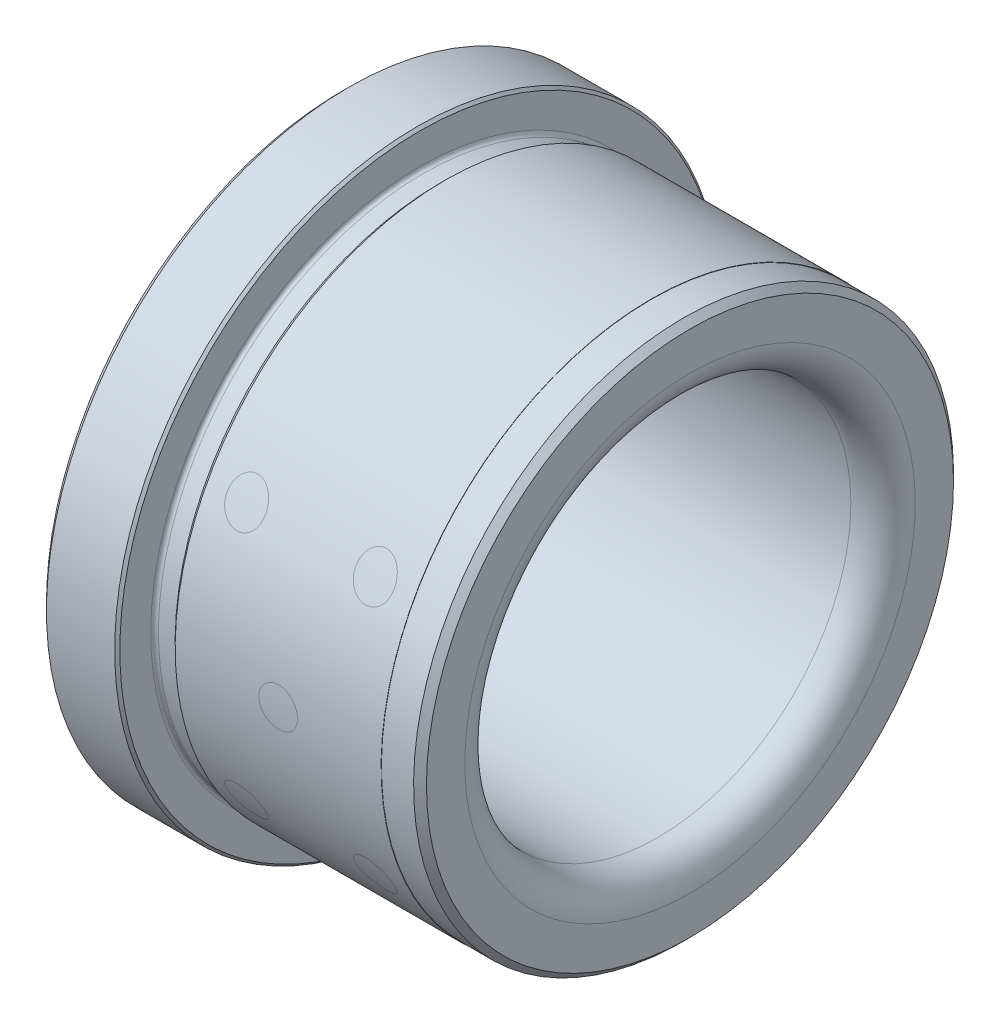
ISO-10303-21;
HEADER;
FILE_DESCRIPTION(('STEP AP214'),'2;1');
FILE_NAME('part.step','',(''),(''),'','','');
FILE_SCHEMA(('AUTOMOTIVE_DESIGN { 1 0 10303 214 1 1 1 1 }'));
ENDSEC;
DATA;
#1=APPLICATION_CONTEXT('core data for automotive mechanical design processes');
#2=APPLICATION_PROTOCOL_DEFINITION('international standard','automotive_design',2000,#1);
#3=PRODUCT_CONTEXT('',#1,'mechanical');
#4=PRODUCT('Part','Part','',(#3));
#5=PRODUCT_RELATED_PRODUCT_CATEGORY('part','',(#4));
#6=PRODUCT_DEFINITION_FORMATION('','',#4);
#7=PRODUCT_DEFINITION_CONTEXT('part definition',#1,'design');
#8=PRODUCT_DEFINITION('design','',#6,#7);
#9=PRODUCT_DEFINITION_SHAPE('','',#8);
#10=(LENGTH_UNIT() NAMED_UNIT(*) SI_UNIT(.MILLI.,.METRE.));
#11=(NAMED_UNIT(*) PLANE_ANGLE_UNIT() SI_UNIT($,.RADIAN.));
#12=(NAMED_UNIT(*) SI_UNIT($,.STERADIAN.) SOLID_ANGLE_UNIT());
#13=UNCERTAINTY_MEASURE_WITH_UNIT(LENGTH_MEASURE(1.E-05),#10,'distance_accuracy_value','');
#14=(GEOMETRIC_REPRESENTATION_CONTEXT(3) GLOBAL_UNCERTAINTY_ASSIGNED_CONTEXT((#13)) GLOBAL_UNIT_ASSIGNED_CONTEXT((#10,
#11,#12)) REPRESENTATION_CONTEXT('',''));
#15=CARTESIAN_POINT('',(0.,0.,0.));
#16=DIRECTION('',(0.,0.,1.));
#17=DIRECTION('',(1.,0.,0.));
#18=AXIS2_PLACEMENT_3D('',#15,#16,#17);
#19=CARTESIAN_POINT('',(13.5,0.,0.));
#20=DIRECTION('',(1.,0.,0.));
#21=DIRECTION('',(0.,1.,0.));
#22=AXIS2_PLACEMENT_3D('',#19,#20,#21);
#23=CYLINDRICAL_SURFACE('',#22,21.);
#24=CARTESIAN_POINT('',(1.,0.,-21.));
#25=CARTESIAN_POINT('',(1.00000369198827,-0.0841405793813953,-20.9999992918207));
#26=CARTESIAN_POINT('',(1.00710343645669,-0.168339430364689,-20.9994889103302));
#27=CARTESIAN_POINT('',(1.03532278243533,-0.334410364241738,-20.9975019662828));
#28=CARTESIAN_POINT('',(1.05645853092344,-0.416279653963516,-20.996024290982));
#29=CARTESIAN_POINT('',(1.11213808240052,-0.575262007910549,-20.9922698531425));
#30=CARTESIAN_POINT('',(1.14667460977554,-0.652377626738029,-20.9899935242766));
#31=CARTESIAN_POINT('',(1.22816306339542,-0.799697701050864,-20.984897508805));
#32=CARTESIAN_POINT('',(1.27511222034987,-0.869903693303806,-20.9820779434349));
#33=CARTESIAN_POINT('',(1.38019085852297,-1.00156534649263,-20.9762061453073));
#34=CARTESIAN_POINT('',(1.43833910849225,-1.06300601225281,-20.9731535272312));
#35=CARTESIAN_POINT('',(1.56412612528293,-1.17526449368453,-20.9671629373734));
#36=CARTESIAN_POINT('',(1.63176529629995,-1.22608185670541,-20.9642249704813));
#37=CARTESIAN_POINT('',(1.77470197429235,-1.31569969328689,-20.9587919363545));
#38=CARTESIAN_POINT('',(1.85000753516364,-1.35448735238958,-20.9562973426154));
#39=CARTESIAN_POINT('',(2.00608302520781,-1.4188628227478,-20.9520374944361));
#40=CARTESIAN_POINT('',(2.08685288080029,-1.44445081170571,-20.9502722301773));
#41=CARTESIAN_POINT('',(2.25141678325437,-1.48165803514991,-20.9476738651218));
#42=CARTESIAN_POINT('',(2.33520538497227,-1.49330123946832,-20.9468391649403));
#43=CARTESIAN_POINT('',(2.50355152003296,-1.50236240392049,-20.9461912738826));
#44=CARTESIAN_POINT('',(2.58810904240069,-1.49978056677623,-20.9463780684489));
#45=CARTESIAN_POINT('',(2.75542904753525,-1.48048479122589,-20.9477506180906));
#46=CARTESIAN_POINT('',(2.83819454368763,-1.46379683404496,-20.948934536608));
#47=CARTESIAN_POINT('',(2.99974664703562,-1.41680285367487,-20.9521650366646));
#48=CARTESIAN_POINT('',(3.07853322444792,-1.38649672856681,-20.95421162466));
#49=CARTESIAN_POINT('',(3.22997424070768,-1.31309735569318,-20.9589389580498));
#50=CARTESIAN_POINT('',(3.30262297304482,-1.26999237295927,-20.9616202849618));
#51=CARTESIAN_POINT('',(3.43966367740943,-1.17222736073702,-20.967314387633));
#52=CARTESIAN_POINT('',(3.50405552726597,-1.11756716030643,-20.9703271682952));
#53=CARTESIAN_POINT('',(3.62290574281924,-0.998097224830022,-20.9763528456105));
#54=CARTESIAN_POINT('',(3.67734151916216,-0.933265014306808,-20.9793657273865));
#55=CARTESIAN_POINT('',(3.77455995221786,-0.795370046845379,-20.9850456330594));
#56=CARTESIAN_POINT('',(3.81734260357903,-0.722307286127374,-20.9877126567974));
#57=CARTESIAN_POINT('',(3.89003863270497,-0.570011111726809,-20.9924006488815));
#58=CARTESIAN_POINT('',(3.91995109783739,-0.490777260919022,-20.9944215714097));
#59=CARTESIAN_POINT('',(3.96604227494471,-0.328394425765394,-20.9975890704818));
#60=CARTESIAN_POINT('',(3.98222119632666,-0.245245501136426,-20.9987356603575));
#61=CARTESIAN_POINT('',(4.00035790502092,-0.077588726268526,-21.0000235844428));
#62=CARTESIAN_POINT('',(4.0023469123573,0.00691573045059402,-21.0001671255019));
#63=CARTESIAN_POINT('',(3.99212898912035,0.175057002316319,-20.9994386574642));
#64=CARTESIAN_POINT('',(3.97992215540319,0.258693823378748,-20.9985666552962));
#65=CARTESIAN_POINT('',(3.94168491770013,0.422637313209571,-20.9959066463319));
#66=CARTESIAN_POINT('',(3.91566889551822,0.502947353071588,-20.9941195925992));
#67=CARTESIAN_POINT('',(3.85056641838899,0.658061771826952,-20.989830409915));
#68=CARTESIAN_POINT('',(3.81147981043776,0.732866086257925,-20.9873282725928));
#69=CARTESIAN_POINT('',(3.72126661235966,0.874988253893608,-20.9818843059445));
#70=CARTESIAN_POINT('',(3.67011923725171,0.942292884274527,-20.9789417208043));
#71=CARTESIAN_POINT('',(3.55726655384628,1.06737189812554,-20.9729503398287));
#72=CARTESIAN_POINT('',(3.49556111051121,1.12514615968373,-20.9699015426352));
#73=CARTESIAN_POINT('',(3.36320887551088,1.22963072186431,-20.9640349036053));
#74=CARTESIAN_POINT('',(3.29254603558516,1.27632072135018,-20.9612174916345));
#75=CARTESIAN_POINT('',(3.14436521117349,1.35717240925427,-20.9561382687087));
#76=CARTESIAN_POINT('',(3.06684727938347,1.39133419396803,-20.9538764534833));
#77=CARTESIAN_POINT('',(2.90722997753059,1.44612479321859,-20.9501666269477));
#78=CARTESIAN_POINT('',(2.82513496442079,1.46676624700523,-20.9487178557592));
#79=CARTESIAN_POINT('',(2.65863369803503,1.49397147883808,-20.9467954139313));
#80=CARTESIAN_POINT('',(2.57422747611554,1.50053544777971,-20.9463217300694));
#81=CARTESIAN_POINT('',(2.40570156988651,1.49939741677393,-20.9464032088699));
#82=CARTESIAN_POINT('',(2.32158166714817,1.49172732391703,-20.9469560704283));
#83=CARTESIAN_POINT('',(2.15582763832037,1.46240519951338,-20.9490234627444));
#84=CARTESIAN_POINT('',(2.0741935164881,1.44075314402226,-20.9505379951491));
#85=CARTESIAN_POINT('',(1.91572469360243,1.38408929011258,-20.954357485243));
#86=CARTESIAN_POINT('',(1.83888987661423,1.34907781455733,-20.95666242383));
#87=CARTESIAN_POINT('',(1.6921841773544,1.26669292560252,-20.9618029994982));
#88=CARTESIAN_POINT('',(1.62231314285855,1.21931978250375,-20.964638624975));
#89=CARTESIAN_POINT('',(1.49135573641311,1.11343715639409,-20.9705285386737));
#90=CARTESIAN_POINT('',(1.43028828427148,1.05490429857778,-20.9735832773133));
#91=CARTESIAN_POINT('',(1.31882308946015,0.928401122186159,-20.9795632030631));
#92=CARTESIAN_POINT('',(1.26842794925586,0.860428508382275,-20.982488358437));
#93=CARTESIAN_POINT('',(1.17968900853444,0.716877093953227,-20.9878834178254));
#94=CARTESIAN_POINT('',(1.14136314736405,0.641287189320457,-20.9903526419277));
#95=CARTESIAN_POINT('',(1.07799488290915,0.484781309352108,-20.9945490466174));
#96=CARTESIAN_POINT('',(1.05293703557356,0.403871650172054,-20.9962770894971));
#97=CARTESIAN_POINT('',(1.02327743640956,0.268728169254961,-20.9983472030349));
#98=CARTESIAN_POINT('',(1.01455980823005,0.215366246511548,-20.9989642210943));
#99=CARTESIAN_POINT('',(1.00291991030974,0.108010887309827,-20.9997908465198));
#100=CARTESIAN_POINT('',(0.999997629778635,0.0540174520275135,-21.0000004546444));
#101=CARTESIAN_POINT('',(1.,0.,-21.));
#102=B_SPLINE_CURVE_WITH_KNOTS('',3,(#24,#25,#26,#27,#28,#29,#30,#31,#32,#33,#34,#35,#36,#37,
#38,#39,#40,#41,#42,#43,#44,#45,#46,#47,#48,#49,#50,#51,#52,#53,#54,#55,#56,#57,#58,#59,#60,#61,
#62,#63,#64,#65,#66,#67,#68,#69,#70,#71,#72,#73,#74,#75,#76,#77,#78,#79,#80,#81,#82,#83,#84,#85,
#86,#87,#88,#89,#90,#91,#92,#93,#94,#95,#96,#97,#98,#99,#100,#101),.UNSPECIFIED.,.T.,.F.,(4,2,2,
2,2,2,2,2,2,2,2,2,2,2,2,2,2,2,2,2,2,2,2,2,2,2,2,2,2,2,2,2,2,2,2,2,2,2,4),(0.,0.252224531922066,
0.504739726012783,0.757118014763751,1.00944004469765,1.26218868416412,1.51494809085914,
1.76797582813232,2.0210001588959,2.27358893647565,2.52617411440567,2.77829508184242,
3.03041793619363,3.28277267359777,3.53513114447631,3.78805527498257,4.04097952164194,
4.29392170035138,4.54686002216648,4.79924166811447,5.05162159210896,5.30373918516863,
5.55585972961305,5.80841798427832,6.06097946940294,6.31400001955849,6.56701862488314,
6.81980036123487,7.07257866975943,7.32479103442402,7.57700383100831,7.82921053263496,
8.08141171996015,8.3341470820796,8.58694400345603,8.84011491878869,9.09299049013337,
9.25491654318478,9.41684229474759),.UNSPECIFIED.);
#103=CARTESIAN_POINT('',(1.,0.,-21.));
#104=VERTEX_POINT('',#103);
#105=EDGE_CURVE('E34',#104,#104,#102,.T.);
#106=ORIENTED_EDGE('',*,*,#105,.T.);
#107=EDGE_LOOP('',(#106));
#108=FACE_BOUND('',#107,.T.);
#109=CARTESIAN_POINT('',(6.,-10.,-18.4661853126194));
#110=CARTESIAN_POINT('',(6.00000430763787,-10.1125946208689,-18.4052091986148));
#111=CARTESIAN_POINT('',(6.01269965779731,-10.2247846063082,-18.3431063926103));
#112=CARTESIAN_POINT('',(6.0627899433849,-10.4439747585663,-18.2192018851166));
#113=CARTESIAN_POINT('',(6.10024370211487,-10.5509619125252,-18.1574012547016));
#114=CARTESIAN_POINT('',(6.19184213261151,-10.7403458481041,-18.0459204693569));
#115=CARTESIAN_POINT('',(6.24274339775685,-10.8240503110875,-17.9957898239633));
#116=CARTESIAN_POINT('',(6.36138616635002,-10.9814426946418,-17.90017756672));
#117=CARTESIAN_POINT('',(6.42908780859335,-11.055153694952,-17.8546853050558));
#118=CARTESIAN_POINT('',(6.56250939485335,-11.1734957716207,-17.7807951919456));
#119=CARTESIAN_POINT('',(6.62495598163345,-11.2208898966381,-17.7508924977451));
#120=CARTESIAN_POINT('',(6.75826979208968,-11.3061718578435,-17.6966954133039));
#121=CARTESIAN_POINT('',(6.82913345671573,-11.344063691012,-17.6723986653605));
#122=CARTESIAN_POINT('',(6.97831968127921,-11.4087225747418,-17.6307275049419));
#123=CARTESIAN_POINT('',(7.05668902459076,-11.4354134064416,-17.6134005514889));
#124=CARTESIAN_POINT('',(7.21809414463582,-11.4756105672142,-17.5872383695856));
#125=CARTESIAN_POINT('',(7.30112610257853,-11.4891275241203,-17.5783962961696));
#126=CARTESIAN_POINT('',(7.45868587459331,-11.5012584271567,-17.5704608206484));
#127=CARTESIAN_POINT('',(7.53304327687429,-11.5014612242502,-17.5703280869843));
#128=CARTESIAN_POINT('',(7.68062618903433,-11.4909199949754,-17.5772238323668));
#129=CARTESIAN_POINT('',(7.75385194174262,-11.4801783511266,-17.5842507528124));
#130=CARTESIAN_POINT('',(7.89406652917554,-11.4490212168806,-17.6045515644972));
#131=CARTESIAN_POINT('',(7.96118796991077,-11.4290197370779,-17.6175579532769));
#132=CARTESIAN_POINT('',(8.09089328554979,-11.3804508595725,-17.6489708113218));
#133=CARTESIAN_POINT('',(8.15347617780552,-11.3518816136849,-17.6673784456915));
#134=CARTESIAN_POINT('',(8.27770897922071,-11.2847332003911,-17.7103501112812));
#135=CARTESIAN_POINT('',(8.33889907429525,-11.2455438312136,-17.7352842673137));
#136=CARTESIAN_POINT('',(8.45386132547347,-11.1598688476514,-17.7893196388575));
#137=CARTESIAN_POINT('',(8.50762984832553,-11.1133796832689,-17.8184228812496));
#138=CARTESIAN_POINT('',(8.61447889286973,-11.0071764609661,-17.8842529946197));
#139=CARTESIAN_POINT('',(8.66632058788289,-10.9465223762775,-17.9214729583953));
#140=CARTESIAN_POINT('',(8.75913853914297,-10.819022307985,-17.9987311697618));
#141=CARTESIAN_POINT('',(8.80010853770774,-10.7521727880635,-18.0387710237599));
#142=CARTESIAN_POINT('',(8.87605896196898,-10.6036499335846,-18.1265295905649));
#143=CARTESIAN_POINT('',(8.9092912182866,-10.5212373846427,-18.1745158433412));
#144=CARTESIAN_POINT('',(8.96072231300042,-10.3522741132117,-18.2712866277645));
#145=CARTESIAN_POINT('',(8.97891353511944,-10.2657213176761,-18.320071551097));
#146=CARTESIAN_POINT('',(9.00072722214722,-10.0832668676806,-18.4211688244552));
#147=CARTESIAN_POINT('',(9.00302955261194,-9.98718146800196,-18.473441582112));
#148=CARTESIAN_POINT('',(8.98906857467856,-9.79522074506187,-18.5759384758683));
#149=CARTESIAN_POINT('',(8.97280333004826,-9.69934544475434,-18.6261623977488));
#150=CARTESIAN_POINT('',(8.92174653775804,-9.51224912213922,-18.7223936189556));
#151=CARTESIAN_POINT('',(8.88722634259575,-9.42098083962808,-18.7684513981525));
#152=CARTESIAN_POINT('',(8.79989294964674,-9.24508140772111,-18.8557179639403));
#153=CARTESIAN_POINT('',(8.74709015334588,-9.16044651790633,-18.8969294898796));
#154=CARTESIAN_POINT('',(8.62954014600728,-9.00878626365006,-18.9696657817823));
#155=CARTESIAN_POINT('',(8.56628775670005,-8.9408624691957,-19.0017277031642));
#156=CARTESIAN_POINT('',(8.4266931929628,-8.81681129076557,-19.0596046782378));
#157=CARTESIAN_POINT('',(8.35036174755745,-8.7606743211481,-19.0854248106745));
#158=CARTESIAN_POINT('',(8.19588857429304,-8.66848611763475,-19.1274577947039));
#159=CARTESIAN_POINT('',(8.1188571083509,-8.63090993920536,-19.1444123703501));
#160=CARTESIAN_POINT('',(7.95853715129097,-8.56922905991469,-19.1721012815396));
#161=CARTESIAN_POINT('',(7.87525231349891,-8.54511656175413,-19.1828392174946));
#162=CARTESIAN_POINT('',(7.71212561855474,-8.51293930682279,-19.1971390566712));
#163=CARTESIAN_POINT('',(7.63255205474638,-8.50373198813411,-19.2012121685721));
#164=CARTESIAN_POINT('',(7.47287458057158,-8.49812104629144,-19.2036962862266));
#165=CARTESIAN_POINT('',(7.39277081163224,-8.5017141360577,-19.2021087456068));
#166=CARTESIAN_POINT('',(7.23706495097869,-8.52120927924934,-19.193464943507));
#167=CARTESIAN_POINT('',(7.1614013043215,-8.53670505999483,-19.1865891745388));
#168=CARTESIAN_POINT('',(7.01392610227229,-8.57886863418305,-19.1677735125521));
#169=CARTESIAN_POINT('',(6.942114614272,-8.60553662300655,-19.1558335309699));
#170=CARTESIAN_POINT('',(6.80302367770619,-8.669518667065,-19.1269624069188));
#171=CARTESIAN_POINT('',(6.73583782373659,-8.70700008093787,-19.1099526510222));
#172=CARTESIAN_POINT('',(6.6088399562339,-8.79101903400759,-19.0714476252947));
#173=CARTESIAN_POINT('',(6.54902908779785,-8.83755797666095,-19.0499516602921));
#174=CARTESIAN_POINT('',(6.43463499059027,-8.94108911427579,-19.0015886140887));
#175=CARTESIAN_POINT('',(6.38056514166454,-8.99853473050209,-18.9744802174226));
#176=CARTESIAN_POINT('',(6.28279206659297,-9.11994979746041,-18.9164226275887));
#177=CARTESIAN_POINT('',(6.23909511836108,-9.18392316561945,-18.8854711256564));
#178=CARTESIAN_POINT('',(6.15908451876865,-9.32256455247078,-18.8174459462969));
#179=CARTESIAN_POINT('',(6.12379806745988,-9.39767641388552,-18.7800716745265));
#180=CARTESIAN_POINT('',(6.06635550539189,-9.55124649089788,-18.7024351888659));
#181=CARTESIAN_POINT('',(6.04418904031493,-9.629702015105,-18.6621752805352));
#182=CARTESIAN_POINT('',(6.01898160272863,-9.7570906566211,-18.5957563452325));
#183=CARTESIAN_POINT('',(6.01185219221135,-9.80558676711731,-18.5702311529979));
#184=CARTESIAN_POINT('',(6.00235966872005,-9.9027470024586,-18.5186024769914));
#185=CARTESIAN_POINT('',(5.99999814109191,-9.95141117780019,-18.4924988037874));
#186=CARTESIAN_POINT('',(6.,-10.,-18.4661853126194));
#187=B_SPLINE_CURVE_WITH_KNOTS('',3,(#109,#110,#111,#112,#113,#114,#115,#116,#117,#118,#119,
#120,#121,#122,#123,#124,#125,#126,#127,#128,#129,#130,#131,#132,#133,#134,#135,#136,#137,#138,
#139,#140,#141,#142,#143,#144,#145,#146,#147,#148,#149,#150,#151,#152,#153,#154,#155,#156,#157,
#158,#159,#160,#161,#162,#163,#164,#165,#166,#167,#168,#169,#170,#171,#172,#173,#174,#175,#176,
#177,#178,#179,#180,#181,#182,#183,#184,#185,#186),.UNSPECIFIED.,.T.,.F.,(4,2,2,2,2,2,2,2,2,2,2,
2,2,2,2,2,2,2,2,2,2,2,2,2,2,2,2,2,2,2,2,2,2,2,2,2,2,2,4),(0.,0.383867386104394,0.76865009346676,
1.09714079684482,1.42485944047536,1.67556164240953,1.92615821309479,2.17843338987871,
2.43050487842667,2.65243294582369,2.87431271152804,3.08710957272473,3.29995237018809,
3.52952158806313,3.75920279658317,4.02230865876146,4.2855656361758,4.5872636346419,
4.88911430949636,5.21577139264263,5.54246254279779,5.86442868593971,6.18621195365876,
6.47915302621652,6.77185493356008,7.03255652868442,7.29310698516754,7.53253360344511,
7.77189874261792,8.00343802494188,8.23498135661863,8.47032047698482,8.70569609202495,
8.95489647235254,9.20424729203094,9.47618266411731,9.7479031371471,9.91350132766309,
10.0791545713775),.UNSPECIFIED.);
#188=CARTESIAN_POINT('',(6.,-10.,-18.4661853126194));
#189=VERTEX_POINT('',#188);
#190=EDGE_CURVE('E51',#189,#189,#187,.T.);
#191=ORIENTED_EDGE('',*,*,#190,.T.);
#192=EDGE_LOOP('',(#191));
#193=FACE_BOUND('',#192,.T.);
#194=CARTESIAN_POINT('',(-4.,-10.,-18.4661853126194));
#195=CARTESIAN_POINT('',(-3.99999569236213,-10.1125946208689,-18.4052091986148));
#196=CARTESIAN_POINT('',(-3.98730034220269,-10.2247846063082,-18.3431063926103));
#197=CARTESIAN_POINT('',(-3.9372100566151,-10.4439747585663,-18.2192018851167));
#198=CARTESIAN_POINT('',(-3.89975629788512,-10.5509619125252,-18.1574012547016));
#199=CARTESIAN_POINT('',(-3.80815786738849,-10.7403458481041,-18.0459204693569));
#200=CARTESIAN_POINT('',(-3.75725660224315,-10.8240503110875,-17.9957898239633));
#201=CARTESIAN_POINT('',(-3.63861383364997,-10.9814426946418,-17.90017756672));
#202=CARTESIAN_POINT('',(-3.57091219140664,-11.055153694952,-17.8546853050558));
#203=CARTESIAN_POINT('',(-3.43749060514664,-11.1734957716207,-17.7807951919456));
#204=CARTESIAN_POINT('',(-3.37504401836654,-11.2208898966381,-17.7508924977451));
#205=CARTESIAN_POINT('',(-3.24173020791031,-11.3061718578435,-17.6966954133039));
#206=CARTESIAN_POINT('',(-3.17086654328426,-11.344063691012,-17.6723986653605));
#207=CARTESIAN_POINT('',(-3.02168031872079,-11.4087225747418,-17.6307275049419));
#208=CARTESIAN_POINT('',(-2.94331097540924,-11.4354134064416,-17.6134005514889));
#209=CARTESIAN_POINT('',(-2.78190585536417,-11.4756105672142,-17.5872383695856));
#210=CARTESIAN_POINT('',(-2.69887389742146,-11.4891275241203,-17.5783962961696));
#211=CARTESIAN_POINT('',(-2.54131412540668,-11.5012584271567,-17.5704608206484));
#212=CARTESIAN_POINT('',(-2.4669567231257,-11.5014612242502,-17.5703280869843));
#213=CARTESIAN_POINT('',(-2.31937381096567,-11.4909199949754,-17.5772238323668));
#214=CARTESIAN_POINT('',(-2.24614805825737,-11.4801783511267,-17.5842507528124));
#215=CARTESIAN_POINT('',(-2.10593347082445,-11.4490212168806,-17.6045515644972));
#216=CARTESIAN_POINT('',(-2.03881203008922,-11.4290197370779,-17.6175579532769));
#217=CARTESIAN_POINT('',(-1.9091067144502,-11.3804508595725,-17.6489708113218));
#218=CARTESIAN_POINT('',(-1.84652382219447,-11.3518816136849,-17.6673784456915));
#219=CARTESIAN_POINT('',(-1.72229102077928,-11.2847332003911,-17.7103501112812));
#220=CARTESIAN_POINT('',(-1.66110092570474,-11.2455438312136,-17.7352842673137));
#221=CARTESIAN_POINT('',(-1.54613867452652,-11.1598688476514,-17.7893196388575));
#222=CARTESIAN_POINT('',(-1.49237015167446,-11.113379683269,-17.8184228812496));
#223=CARTESIAN_POINT('',(-1.38552110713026,-11.0071764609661,-17.8842529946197));
#224=CARTESIAN_POINT('',(-1.3336794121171,-10.9465223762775,-17.9214729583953));
#225=CARTESIAN_POINT('',(-1.24086146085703,-10.819022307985,-17.9987311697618));
#226=CARTESIAN_POINT('',(-1.19989146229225,-10.7521727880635,-18.0387710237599));
#227=CARTESIAN_POINT('',(-1.12394103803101,-10.6036499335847,-18.1265295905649));
#228=CARTESIAN_POINT('',(-1.09070878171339,-10.5212373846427,-18.1745158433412));
#229=CARTESIAN_POINT('',(-1.03927768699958,-10.3522741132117,-18.2712866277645));
#230=CARTESIAN_POINT('',(-1.02108646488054,-10.2657213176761,-18.320071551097));
#231=CARTESIAN_POINT('',(-0.99927277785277,-10.0832668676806,-18.4211688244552));
#232=CARTESIAN_POINT('',(-0.996970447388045,-9.98718146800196,-18.473441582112));
#233=CARTESIAN_POINT('',(-1.01093142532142,-9.79522074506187,-18.5759384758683));
#234=CARTESIAN_POINT('',(-1.02719666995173,-9.69934544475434,-18.6261623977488));
#235=CARTESIAN_POINT('',(-1.07825346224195,-9.51224912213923,-18.7223936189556));
#236=CARTESIAN_POINT('',(-1.11277365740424,-9.42098083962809,-18.7684513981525));
#237=CARTESIAN_POINT('',(-1.20010705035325,-9.24508140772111,-18.8557179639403));
#238=CARTESIAN_POINT('',(-1.25290984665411,-9.16044651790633,-18.8969294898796));
#239=CARTESIAN_POINT('',(-1.37045985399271,-9.00878626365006,-18.9696657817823));
#240=CARTESIAN_POINT('',(-1.43371224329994,-8.9408624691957,-19.0017277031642));
#241=CARTESIAN_POINT('',(-1.57330680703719,-8.81681129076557,-19.0596046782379));
#242=CARTESIAN_POINT('',(-1.64963825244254,-8.7606743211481,-19.0854248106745));
#243=CARTESIAN_POINT('',(-1.80411142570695,-8.66848611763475,-19.1274577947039));
#244=CARTESIAN_POINT('',(-1.88114289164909,-8.63090993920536,-19.1444123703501));
#245=CARTESIAN_POINT('',(-2.04146284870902,-8.56922905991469,-19.1721012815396));
#246=CARTESIAN_POINT('',(-2.12474768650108,-8.54511656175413,-19.1828392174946));
#247=CARTESIAN_POINT('',(-2.28787438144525,-8.51293930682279,-19.1971390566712));
#248=CARTESIAN_POINT('',(-2.36744794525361,-8.50373198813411,-19.2012121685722));
#249=CARTESIAN_POINT('',(-2.52712541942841,-8.49812104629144,-19.2036962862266));
#250=CARTESIAN_POINT('',(-2.60722918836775,-8.50171413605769,-19.2021087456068));
#251=CARTESIAN_POINT('',(-2.7629350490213,-8.52120927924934,-19.193464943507));
#252=CARTESIAN_POINT('',(-2.83859869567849,-8.53670505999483,-19.1865891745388));
#253=CARTESIAN_POINT('',(-2.9860738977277,-8.57886863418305,-19.1677735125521));
#254=CARTESIAN_POINT('',(-3.05788538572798,-8.60553662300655,-19.1558335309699));
#255=CARTESIAN_POINT('',(-3.1969763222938,-8.66951866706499,-19.1269624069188));
#256=CARTESIAN_POINT('',(-3.2641621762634,-8.70700008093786,-19.1099526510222));
#257=CARTESIAN_POINT('',(-3.39116004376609,-8.79101903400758,-19.0714476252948));
#258=CARTESIAN_POINT('',(-3.45097091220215,-8.83755797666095,-19.0499516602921));
#259=CARTESIAN_POINT('',(-3.56536500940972,-8.94108911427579,-19.0015886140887));
#260=CARTESIAN_POINT('',(-3.61943485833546,-8.99853473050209,-18.9744802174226));
#261=CARTESIAN_POINT('',(-3.71720793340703,-9.11994979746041,-18.9164226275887));
#262=CARTESIAN_POINT('',(-3.76090488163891,-9.18392316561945,-18.8854711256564));
#263=CARTESIAN_POINT('',(-3.84091548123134,-9.32256455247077,-18.8174459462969));
#264=CARTESIAN_POINT('',(-3.87620193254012,-9.39767641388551,-18.7800716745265));
#265=CARTESIAN_POINT('',(-3.9336444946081,-9.55124649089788,-18.7024351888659));
#266=CARTESIAN_POINT('',(-3.95581095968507,-9.62970201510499,-18.6621752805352));
#267=CARTESIAN_POINT('',(-3.98101839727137,-9.7570906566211,-18.5957563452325));
#268=CARTESIAN_POINT('',(-3.98814780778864,-9.80558676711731,-18.5702311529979));
#269=CARTESIAN_POINT('',(-3.99764033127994,-9.9027470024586,-18.5186024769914));
#270=CARTESIAN_POINT('',(-4.00000185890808,-9.95141117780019,-18.4924988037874));
#271=CARTESIAN_POINT('',(-4.,-10.,-18.4661853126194));
#272=B_SPLINE_CURVE_WITH_KNOTS('',3,(#194,#195,#196,#197,#198,#199,#200,#201,#202,#203,#204,
#205,#206,#207,#208,#209,#210,#211,#212,#213,#214,#215,#216,#217,#218,#219,#220,#221,#222,#223,
#224,#225,#226,#227,#228,#229,#230,#231,#232,#233,#234,#235,#236,#237,#238,#239,#240,#241,#242,
#243,#244,#245,#246,#247,#248,#249,#250,#251,#252,#253,#254,#255,#256,#257,#258,#259,#260,#261,
#262,#263,#264,#265,#266,#267,#268,#269,#270,#271),.UNSPECIFIED.,.T.,.F.,(4,2,2,2,2,2,2,2,2,2,2,
2,2,2,2,2,2,2,2,2,2,2,2,2,2,2,2,2,2,2,2,2,2,2,2,2,2,2,4),(0.,0.383867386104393,
0.768650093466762,1.09714079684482,1.42485944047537,1.67556164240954,1.9261582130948,
2.17843338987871,2.43050487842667,2.65243294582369,2.87431271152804,3.08710957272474,
3.2999523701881,3.52952158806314,3.75920279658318,4.02230865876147,4.28556563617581,
4.5872636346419,4.88911430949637,5.21577139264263,5.5424625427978,5.86442868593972,
6.18621195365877,6.47915302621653,6.7718549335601,7.03255652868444,7.29310698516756,
7.53253360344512,7.77189874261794,8.00343802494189,8.23498135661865,8.47032047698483,
8.70569609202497,8.95489647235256,9.20424729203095,9.47618266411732,9.74790313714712,
9.91350132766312,10.0791545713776),.UNSPECIFIED.);
#273=CARTESIAN_POINT('',(-4.,-10.,-18.4661853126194));
#274=VERTEX_POINT('',#273);
#275=EDGE_CURVE('E98',#274,#274,#272,.T.);
#276=ORIENTED_EDGE('',*,*,#275,.T.);
#277=EDGE_LOOP('',(#276));
#278=FACE_BOUND('',#277,.T.);
#279=CARTESIAN_POINT('',(6.,10.,-18.4661853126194));
#280=CARTESIAN_POINT('',(6.00000179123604,9.90899251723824,-18.5154679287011));
#281=CARTESIAN_POINT('',(6.00828834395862,9.81758602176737,-18.5640899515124));
#282=CARTESIAN_POINT('',(6.04180505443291,9.63647346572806,-18.658746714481));
#283=CARTESIAN_POINT('',(6.06704259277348,9.54676816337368,-18.7047803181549));
#284=CARTESIAN_POINT('',(6.13473540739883,9.37158783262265,-18.7931637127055));
#285=CARTESIAN_POINT('',(6.17725957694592,9.2861312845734,-18.8354979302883));
#286=CARTESIAN_POINT('',(6.27917193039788,9.12318982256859,-18.9149576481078));
#287=CARTESIAN_POINT('',(6.33855049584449,9.04570039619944,-18.952086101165));
#288=CARTESIAN_POINT('',(6.46713238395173,8.90856141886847,-19.0169081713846));
#289=CARTESIAN_POINT('',(6.53503103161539,8.84794621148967,-19.0451416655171));
#290=CARTESIAN_POINT('',(6.68222390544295,8.7392089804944,-19.095282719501));
#291=CARTESIAN_POINT('',(6.7615094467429,8.69107751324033,-19.1171950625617));
#292=CARTESIAN_POINT('',(6.92012693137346,8.61411065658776,-19.1519894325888));
#293=CARTESIAN_POINT('',(6.99858031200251,8.58378006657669,-19.1655779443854));
#294=CARTESIAN_POINT('',(7.16020971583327,8.53657311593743,-19.1866515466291));
#295=CARTESIAN_POINT('',(7.24338336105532,8.51969004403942,-19.1941396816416));
#296=CARTESIAN_POINT('',(7.40578777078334,8.50088829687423,-19.2024736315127));
#297=CARTESIAN_POINT('',(7.48488631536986,8.49800374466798,-19.2037482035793));
#298=CARTESIAN_POINT('',(7.64244096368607,8.50469951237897,-19.2007838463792));
#299=CARTESIAN_POINT('',(7.72089718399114,8.51427751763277,-19.1965459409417));
#300=CARTESIAN_POINT('',(7.8732944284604,8.5451547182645,-19.1828205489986));
#301=CARTESIAN_POINT('',(7.9472949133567,8.56621080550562,-19.1734419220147));
#302=CARTESIAN_POINT('',(8.09052464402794,8.61901912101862,-19.1497608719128));
#303=CARTESIAN_POINT('',(8.15975357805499,8.6507720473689,-19.1354581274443));
#304=CARTESIAN_POINT('',(8.29361006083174,8.72477782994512,-19.1018308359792));
#305=CARTESIAN_POINT('',(8.3580589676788,8.76729516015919,-19.0823791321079));
#306=CARTESIAN_POINT('',(8.47881670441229,8.86080944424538,-19.0391361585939));
#307=CARTESIAN_POINT('',(8.53512356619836,8.91180844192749,-19.0153438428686));
#308=CARTESIAN_POINT('',(8.64214644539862,9.0243308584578,-18.9622142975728));
#309=CARTESIAN_POINT('',(8.69222575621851,9.08633307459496,-18.9326107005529));
#310=CARTESIAN_POINT('',(8.78132027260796,9.21614813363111,-18.8697593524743));
#311=CARTESIAN_POINT('',(8.82033141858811,9.28396309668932,-18.8365102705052));
#312=CARTESIAN_POINT('',(8.89014141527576,9.43019448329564,-18.7637604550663));
#313=CARTESIAN_POINT('',(8.91980614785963,9.50900574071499,-18.7239658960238));
#314=CARTESIAN_POINT('',(8.96543508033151,9.66917733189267,-18.6417576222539));
#315=CARTESIAN_POINT('',(8.98139336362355,9.75053875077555,-18.5993427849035));
#316=CARTESIAN_POINT('',(9.00069733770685,9.92204405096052,-18.5084672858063));
#317=CARTESIAN_POINT('',(9.00262333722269,10.0122531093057,-18.4598260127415));
#318=CARTESIAN_POINT('',(8.99047485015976,10.1911264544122,-18.3616820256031));
#319=CARTESIAN_POINT('',(8.97639362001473,10.2797900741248,-18.3121789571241));
#320=CARTESIAN_POINT('',(8.93116281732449,10.4592300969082,-18.2103221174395));
#321=CARTESIAN_POINT('',(8.89894150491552,10.5497555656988,-18.1579974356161));
#322=CARTESIAN_POINT('',(8.81717073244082,10.7241103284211,-18.0555722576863));
#323=CARTESIAN_POINT('',(8.76761217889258,10.8079360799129,-18.0054729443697));
#324=CARTESIAN_POINT('',(8.65268719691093,10.9646759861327,-17.9104478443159));
#325=CARTESIAN_POINT('',(8.58760212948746,11.0377506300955,-17.8654489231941));
#326=CARTESIAN_POINT('',(8.44211150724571,11.1713810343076,-17.7821943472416));
#327=CARTESIAN_POINT('',(8.3617374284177,11.231961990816,-17.7439251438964));
#328=CARTESIAN_POINT('',(8.21185515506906,11.3223674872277,-17.6863233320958));
#329=CARTESIAN_POINT('',(8.1455480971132,11.3560594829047,-17.6646846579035));
#330=CARTESIAN_POINT('',(8.00719179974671,11.4136319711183,-17.6275404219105));
#331=CARTESIAN_POINT('',(7.93514699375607,11.4375199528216,-17.6120301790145));
#332=CARTESIAN_POINT('',(7.7867827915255,11.4743209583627,-17.5880770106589));
#333=CARTESIAN_POINT('',(7.71044512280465,11.4871825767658,-17.5796671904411));
#334=CARTESIAN_POINT('',(7.55623999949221,11.5009404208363,-17.5706699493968));
#335=CARTESIAN_POINT('',(7.47837294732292,11.5018397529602,-17.5700804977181));
#336=CARTESIAN_POINT('',(7.32996221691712,11.4920375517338,-17.5764927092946));
#337=CARTESIAN_POINT('',(7.25932880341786,11.4822533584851,-17.5828941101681));
#338=CARTESIAN_POINT('',(7.12097460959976,11.4530449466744,-17.6019334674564));
#339=CARTESIAN_POINT('',(7.0532539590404,11.4336202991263,-17.614571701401));
#340=CARTESIAN_POINT('',(6.92102974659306,11.3855831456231,-17.6456602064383));
#341=CARTESIAN_POINT('',(6.85661513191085,11.3567981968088,-17.6642194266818));
#342=CARTESIAN_POINT('',(6.73364486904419,11.2913394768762,-17.7061334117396));
#343=CARTESIAN_POINT('',(6.67509120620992,11.2546630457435,-17.729489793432));
#344=CARTESIAN_POINT('',(6.55811140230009,11.169896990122,-17.7830310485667));
#345=CARTESIAN_POINT('',(6.50051239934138,11.1209719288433,-17.8136961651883));
#346=CARTESIAN_POINT('',(6.39423724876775,11.016297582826,-17.8786181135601));
#347=CARTESIAN_POINT('',(6.34556687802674,10.9605439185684,-17.9128772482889));
#348=CARTESIAN_POINT('',(6.25072355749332,10.834534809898,-17.9894158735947));
#349=CARTESIAN_POINT('',(6.20609827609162,10.7633697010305,-18.0321167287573));
#350=CARTESIAN_POINT('',(6.12962456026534,10.6156252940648,-18.1194886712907));
#351=CARTESIAN_POINT('',(6.09777785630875,10.5390452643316,-18.1641600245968));
#352=CARTESIAN_POINT('',(6.04848619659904,10.3862709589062,-18.2519238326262));
#353=CARTESIAN_POINT('',(6.0303719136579,10.3102682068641,-18.2949757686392));
#354=CARTESIAN_POINT('',(6.00612729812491,10.1562755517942,-18.380909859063));
#355=CARTESIAN_POINT('',(5.99999845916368,10.0782854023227,-18.4237919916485));
#356=CARTESIAN_POINT('',(6.,10.,-18.4661853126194));
#357=B_SPLINE_CURVE_WITH_KNOTS('',3,(#279,#280,#281,#282,#283,#284,#285,#286,#287,#288,#289,
#290,#291,#292,#293,#294,#295,#296,#297,#298,#299,#300,#301,#302,#303,#304,#305,#306,#307,#308,
#309,#310,#311,#312,#313,#314,#315,#316,#317,#318,#319,#320,#321,#322,#323,#324,#325,#326,#327,
#328,#329,#330,#331,#332,#333,#334,#335,#336,#337,#338,#339,#340,#341,#342,#343,#344,#345,#346,
#347,#348,#349,#350,#351,#352,#353,#354,#355,#356),.UNSPECIFIED.,.T.,.F.,(4,2,2,2,2,2,2,2,2,2,2,
2,2,2,2,2,2,2,2,2,2,2,2,2,2,2,2,2,2,2,2,2,2,2,2,2,2,2,4),(0.,0.310191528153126,
0.620518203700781,0.932093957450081,1.24349225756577,1.52779141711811,1.81187488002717,
2.06613694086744,2.32027202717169,2.55659554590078,2.79287517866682,3.02433451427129,
3.25580895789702,3.49364204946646,3.73153253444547,3.98553064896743,4.23962180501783,
4.51788209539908,4.79626244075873,5.10246054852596,5.40878770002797,5.73546476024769,
6.0623134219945,6.38363734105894,6.70430676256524,6.93573323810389,7.16698259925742,
7.39930428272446,7.63156563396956,7.8453468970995,8.05913767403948,8.27711425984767,
8.49516443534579,8.73889428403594,8.98278127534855,9.2643494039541,9.54595564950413,
9.81275176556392,10.0795811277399),.UNSPECIFIED.);
#358=CARTESIAN_POINT('',(6.,10.,-18.4661853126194));
#359=VERTEX_POINT('',#358);
#360=EDGE_CURVE('E85',#359,#359,#357,.T.);
#361=ORIENTED_EDGE('',*,*,#360,.T.);
#362=EDGE_LOOP('',(#361));
#363=FACE_BOUND('',#362,.T.);
#364=CARTESIAN_POINT('',(-4.,10.,-18.4661853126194));
#365=CARTESIAN_POINT('',(-3.99999820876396,9.90899251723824,-18.5154679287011));
#366=CARTESIAN_POINT('',(-3.99171165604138,9.81758602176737,-18.5640899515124));
#367=CARTESIAN_POINT('',(-3.95819494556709,9.63647346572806,-18.658746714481));
#368=CARTESIAN_POINT('',(-3.93295740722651,9.54676816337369,-18.7047803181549));
#369=CARTESIAN_POINT('',(-3.86526459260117,9.37158783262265,-18.7931637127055));
#370=CARTESIAN_POINT('',(-3.82274042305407,9.2861312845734,-18.8354979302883));
#371=CARTESIAN_POINT('',(-3.72082806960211,9.12318982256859,-18.9149576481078));
#372=CARTESIAN_POINT('',(-3.6614495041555,9.04570039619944,-18.952086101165));
#373=CARTESIAN_POINT('',(-3.53286761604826,8.90856141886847,-19.0169081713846));
#374=CARTESIAN_POINT('',(-3.4649689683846,8.84794621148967,-19.0451416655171));
#375=CARTESIAN_POINT('',(-3.31777609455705,8.7392089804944,-19.095282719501));
#376=CARTESIAN_POINT('',(-3.2384905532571,8.69107751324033,-19.1171950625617));
#377=CARTESIAN_POINT('',(-3.07987306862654,8.61411065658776,-19.1519894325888));
#378=CARTESIAN_POINT('',(-3.00141968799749,8.58378006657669,-19.1655779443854));
#379=CARTESIAN_POINT('',(-2.83979028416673,8.53657311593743,-19.1866515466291));
#380=CARTESIAN_POINT('',(-2.75661663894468,8.51969004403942,-19.1941396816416));
#381=CARTESIAN_POINT('',(-2.59421222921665,8.50088829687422,-19.2024736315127));
#382=CARTESIAN_POINT('',(-2.51511368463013,8.49800374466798,-19.2037482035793));
#383=CARTESIAN_POINT('',(-2.35755903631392,8.50469951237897,-19.2007838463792));
#384=CARTESIAN_POINT('',(-2.27910281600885,8.51427751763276,-19.1965459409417));
#385=CARTESIAN_POINT('',(-2.12670557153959,8.5451547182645,-19.1828205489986));
#386=CARTESIAN_POINT('',(-2.0527050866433,8.56621080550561,-19.1734419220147));
#387=CARTESIAN_POINT('',(-1.90947535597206,8.61901912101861,-19.1497608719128));
#388=CARTESIAN_POINT('',(-1.840246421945,8.65077204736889,-19.1354581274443));
#389=CARTESIAN_POINT('',(-1.70638993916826,8.72477782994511,-19.1018308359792));
#390=CARTESIAN_POINT('',(-1.64194103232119,8.76729516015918,-19.0823791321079));
#391=CARTESIAN_POINT('',(-1.5211832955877,8.86080944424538,-19.0391361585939));
#392=CARTESIAN_POINT('',(-1.46487643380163,8.91180844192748,-19.0153438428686));
#393=CARTESIAN_POINT('',(-1.35785355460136,9.02433085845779,-18.9622142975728));
#394=CARTESIAN_POINT('',(-1.30777424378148,9.08633307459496,-18.9326107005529));
#395=CARTESIAN_POINT('',(-1.21867972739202,9.21614813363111,-18.8697593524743));
#396=CARTESIAN_POINT('',(-1.17966858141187,9.28396309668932,-18.8365102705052));
#397=CARTESIAN_POINT('',(-1.10985858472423,9.43019448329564,-18.7637604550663));
#398=CARTESIAN_POINT('',(-1.08019385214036,9.50900574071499,-18.7239658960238));
#399=CARTESIAN_POINT('',(-1.03456491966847,9.66917733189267,-18.6417576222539));
#400=CARTESIAN_POINT('',(-1.01860663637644,9.75053875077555,-18.5993427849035));
#401=CARTESIAN_POINT('',(-0.99930266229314,9.92204405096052,-18.5084672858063));
#402=CARTESIAN_POINT('',(-0.997376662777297,10.0122531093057,-18.4598260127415));
#403=CARTESIAN_POINT('',(-1.00952514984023,10.1911264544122,-18.361682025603));
#404=CARTESIAN_POINT('',(-1.02360637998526,10.2797900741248,-18.3121789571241));
#405=CARTESIAN_POINT('',(-1.0688371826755,10.4592300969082,-18.2103221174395));
#406=CARTESIAN_POINT('',(-1.10105849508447,10.5497555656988,-18.1579974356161));
#407=CARTESIAN_POINT('',(-1.18282926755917,10.7241103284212,-18.0555722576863));
#408=CARTESIAN_POINT('',(-1.23238782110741,10.8079360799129,-18.0054729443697));
#409=CARTESIAN_POINT('',(-1.34731280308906,10.9646759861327,-17.9104478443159));
#410=CARTESIAN_POINT('',(-1.41239787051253,11.0377506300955,-17.8654489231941));
#411=CARTESIAN_POINT('',(-1.55788849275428,11.1713810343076,-17.7821943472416));
#412=CARTESIAN_POINT('',(-1.63826257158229,11.231961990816,-17.7439251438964));
#413=CARTESIAN_POINT('',(-1.78814484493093,11.3223674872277,-17.6863233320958));
#414=CARTESIAN_POINT('',(-1.8544519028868,11.3560594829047,-17.6646846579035));
#415=CARTESIAN_POINT('',(-1.99280820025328,11.4136319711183,-17.6275404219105));
#416=CARTESIAN_POINT('',(-2.06485300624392,11.4375199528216,-17.6120301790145));
#417=CARTESIAN_POINT('',(-2.21321720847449,11.4743209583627,-17.5880770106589));
#418=CARTESIAN_POINT('',(-2.28955487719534,11.4871825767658,-17.5796671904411));
#419=CARTESIAN_POINT('',(-2.44376000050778,11.5009404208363,-17.5706699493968));
#420=CARTESIAN_POINT('',(-2.52162705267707,11.5018397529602,-17.5700804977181));
#421=CARTESIAN_POINT('',(-2.67003778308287,11.4920375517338,-17.5764927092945));
#422=CARTESIAN_POINT('',(-2.74067119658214,11.4822533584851,-17.5828941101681));
#423=CARTESIAN_POINT('',(-2.87902539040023,11.4530449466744,-17.6019334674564));
#424=CARTESIAN_POINT('',(-2.9467460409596,11.4336202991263,-17.614571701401));
#425=CARTESIAN_POINT('',(-3.07897025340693,11.3855831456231,-17.6456602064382));
#426=CARTESIAN_POINT('',(-3.14338486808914,11.3567981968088,-17.6642194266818));
#427=CARTESIAN_POINT('',(-3.26635513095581,11.2913394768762,-17.7061334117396));
#428=CARTESIAN_POINT('',(-3.32490879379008,11.2546630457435,-17.729489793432));
#429=CARTESIAN_POINT('',(-3.44188859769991,11.169896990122,-17.7830310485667));
#430=CARTESIAN_POINT('',(-3.49948760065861,11.1209719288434,-17.8136961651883));
#431=CARTESIAN_POINT('',(-3.60576275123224,11.016297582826,-17.8786181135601));
#432=CARTESIAN_POINT('',(-3.65443312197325,10.9605439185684,-17.9128772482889));
#433=CARTESIAN_POINT('',(-3.74927644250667,10.834534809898,-17.9894158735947));
#434=CARTESIAN_POINT('',(-3.79390172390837,10.7633697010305,-18.0321167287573));
#435=CARTESIAN_POINT('',(-3.87037543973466,10.6156252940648,-18.1194886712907));
#436=CARTESIAN_POINT('',(-3.90222214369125,10.5390452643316,-18.1641600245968));
#437=CARTESIAN_POINT('',(-3.95151380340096,10.3862709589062,-18.2519238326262));
#438=CARTESIAN_POINT('',(-3.96962808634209,10.3102682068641,-18.2949757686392));
#439=CARTESIAN_POINT('',(-3.99387270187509,10.1562755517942,-18.380909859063));
#440=CARTESIAN_POINT('',(-4.00000154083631,10.0782854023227,-18.4237919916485));
#441=CARTESIAN_POINT('',(-4.,10.,-18.4661853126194));
#442=B_SPLINE_CURVE_WITH_KNOTS('',3,(#364,#365,#366,#367,#368,#369,#370,#371,#372,#373,#374,
#375,#376,#377,#378,#379,#380,#381,#382,#383,#384,#385,#386,#387,#388,#389,#390,#391,#392,#393,
#394,#395,#396,#397,#398,#399,#400,#401,#402,#403,#404,#405,#406,#407,#408,#409,#410,#411,#412,
#413,#414,#415,#416,#417,#418,#419,#420,#421,#422,#423,#424,#425,#426,#427,#428,#429,#430,#431,
#432,#433,#434,#435,#436,#437,#438,#439,#440,#441),.UNSPECIFIED.,.T.,.F.,(4,2,2,2,2,2,2,2,2,2,2,
2,2,2,2,2,2,2,2,2,2,2,2,2,2,2,2,2,2,2,2,2,2,2,2,2,2,2,4),(0.,0.310191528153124,
0.620518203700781,0.932093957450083,1.24349225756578,1.52779141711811,1.81187488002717,
2.06613694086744,2.32027202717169,2.55659554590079,2.79287517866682,3.02433451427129,
3.25580895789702,3.49364204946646,3.73153253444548,3.98553064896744,4.23962180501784,
4.51788209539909,4.79626244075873,5.10246054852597,5.40878770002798,5.7354647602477,
6.06231342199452,6.38363734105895,6.70430676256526,6.93573323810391,7.16698259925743,
7.39930428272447,7.63156563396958,7.84534689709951,8.0591376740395,8.27711425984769,
8.49516443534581,8.73889428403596,8.98278127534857,9.26434940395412,9.54595564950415,
9.81275176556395,10.0795811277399),.UNSPECIFIED.);
#443=CARTESIAN_POINT('',(-4.,10.,-18.4661853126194));
#444=VERTEX_POINT('',#443);
#445=EDGE_CURVE('E91',#444,#444,#442,.T.);
#446=ORIENTED_EDGE('',*,*,#445,.T.);
#447=EDGE_LOOP('',(#446));
#448=FACE_BOUND('',#447,.T.);
#449=CARTESIAN_POINT('',(-5.50000000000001,0.,0.));
#450=DIRECTION('',(1.,0.,0.));
#451=DIRECTION('',(0.,1.,0.));
#452=AXIS2_PLACEMENT_3D('',#449,#450,#451);
#453=CIRCLE('',#452,21.);
#454=CARTESIAN_POINT('',(-5.50000000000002,21.,0.));
#455=VERTEX_POINT('',#454);
#456=EDGE_CURVE('E189',#455,#455,#453,.T.);
#457=ORIENTED_EDGE('',*,*,#456,.T.);
#458=EDGE_LOOP('',(#457));
#459=FACE_BOUND('',#458,.T.);
#460=CARTESIAN_POINT('',(10.5,0.,0.));
#461=DIRECTION('',(1.,0.,0.));
#462=DIRECTION('',(0.,1.,0.));
#463=AXIS2_PLACEMENT_3D('',#460,#461,#462);
#464=CIRCLE('',#463,21.);
#465=CARTESIAN_POINT('',(10.5,21.,0.));
#466=VERTEX_POINT('',#465);
#467=EDGE_CURVE('E192',#466,#466,#464,.T.);
#468=ORIENTED_EDGE('',*,*,#467,.F.);
#469=EDGE_LOOP('',(#468));
#470=FACE_BOUND('',#469,.T.);
#471=CARTESIAN_POINT('',(-4.,10.,18.4661853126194));
#472=CARTESIAN_POINT('',(-3.99999569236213,10.1125946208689,18.4052091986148));
#473=CARTESIAN_POINT('',(-3.98730034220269,10.2247846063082,18.3431063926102));
#474=CARTESIAN_POINT('',(-3.9372100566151,10.4439747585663,18.2192018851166));
#475=CARTESIAN_POINT('',(-3.89975629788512,10.5509619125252,18.1574012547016));
#476=CARTESIAN_POINT('',(-3.80815786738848,10.7403458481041,18.0459204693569));
#477=CARTESIAN_POINT('',(-3.75725660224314,10.8240503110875,17.9957898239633));
#478=CARTESIAN_POINT('',(-3.63861383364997,10.9814426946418,17.90017756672));
#479=CARTESIAN_POINT('',(-3.57091219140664,11.055153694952,17.8546853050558));
#480=CARTESIAN_POINT('',(-3.43749060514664,11.1734957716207,17.7807951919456));
#481=CARTESIAN_POINT('',(-3.37504401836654,11.2208898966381,17.7508924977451));
#482=CARTESIAN_POINT('',(-3.24173020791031,11.3061718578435,17.6966954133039));
#483=CARTESIAN_POINT('',(-3.17086654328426,11.344063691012,17.6723986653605));
#484=CARTESIAN_POINT('',(-3.02168031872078,11.4087225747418,17.6307275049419));
#485=CARTESIAN_POINT('',(-2.94331097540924,11.4354134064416,17.6134005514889));
#486=CARTESIAN_POINT('',(-2.78190585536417,11.4756105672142,17.5872383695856));
#487=CARTESIAN_POINT('',(-2.69887389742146,11.4891275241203,17.5783962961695));
#488=CARTESIAN_POINT('',(-2.54131412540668,11.5012584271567,17.5704608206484));
#489=CARTESIAN_POINT('',(-2.4669567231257,11.5014612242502,17.5703280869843));
#490=CARTESIAN_POINT('',(-2.31937381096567,11.4909199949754,17.5772238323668));
#491=CARTESIAN_POINT('',(-2.24614805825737,11.4801783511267,17.5842507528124));
#492=CARTESIAN_POINT('',(-2.10593347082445,11.4490212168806,17.6045515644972));
#493=CARTESIAN_POINT('',(-2.03881203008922,11.4290197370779,17.6175579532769));
#494=CARTESIAN_POINT('',(-1.9091067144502,11.3804508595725,17.6489708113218));
#495=CARTESIAN_POINT('',(-1.84652382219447,11.3518816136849,17.6673784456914));
#496=CARTESIAN_POINT('',(-1.72229102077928,11.2847332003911,17.7103501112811));
#497=CARTESIAN_POINT('',(-1.66110092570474,11.2455438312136,17.7352842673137));
#498=CARTESIAN_POINT('',(-1.54613867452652,11.1598688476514,17.7893196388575));
#499=CARTESIAN_POINT('',(-1.49237015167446,11.113379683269,17.8184228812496));
#500=CARTESIAN_POINT('',(-1.38552110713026,11.0071764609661,17.8842529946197));
#501=CARTESIAN_POINT('',(-1.3336794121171,10.9465223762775,17.9214729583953));
#502=CARTESIAN_POINT('',(-1.24086146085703,10.819022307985,17.9987311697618));
#503=CARTESIAN_POINT('',(-1.19989146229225,10.7521727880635,18.0387710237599));
#504=CARTESIAN_POINT('',(-1.12394103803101,10.6036499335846,18.1265295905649));
#505=CARTESIAN_POINT('',(-1.09070878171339,10.5212373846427,18.1745158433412));
#506=CARTESIAN_POINT('',(-1.03927768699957,10.3522741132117,18.2712866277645));
#507=CARTESIAN_POINT('',(-1.02108646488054,10.2657213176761,18.320071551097));
#508=CARTESIAN_POINT('',(-0.99927277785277,10.0832668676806,18.4211688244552));
#509=CARTESIAN_POINT('',(-0.996970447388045,9.98718146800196,18.473441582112));
#510=CARTESIAN_POINT('',(-1.01093142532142,9.79522074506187,18.5759384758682));
#511=CARTESIAN_POINT('',(-1.02719666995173,9.69934544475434,18.6261623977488));
#512=CARTESIAN_POINT('',(-1.07825346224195,9.51224912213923,18.7223936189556));
#513=CARTESIAN_POINT('',(-1.11277365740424,9.42098083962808,18.7684513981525));
#514=CARTESIAN_POINT('',(-1.20010705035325,9.24508140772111,18.8557179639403));
#515=CARTESIAN_POINT('',(-1.25290984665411,9.16044651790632,18.8969294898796));
#516=CARTESIAN_POINT('',(-1.37045985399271,9.00878626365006,18.9696657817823));
#517=CARTESIAN_POINT('',(-1.43371224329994,8.9408624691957,19.0017277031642));
#518=CARTESIAN_POINT('',(-1.57330680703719,8.81681129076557,19.0596046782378));
#519=CARTESIAN_POINT('',(-1.64963825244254,8.7606743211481,19.0854248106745));
#520=CARTESIAN_POINT('',(-1.80411142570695,8.66848611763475,19.1274577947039));
#521=CARTESIAN_POINT('',(-1.88114289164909,8.63090993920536,19.1444123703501));
#522=CARTESIAN_POINT('',(-2.04146284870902,8.56922905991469,19.1721012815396));
#523=CARTESIAN_POINT('',(-2.12474768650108,8.54511656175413,19.1828392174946));
#524=CARTESIAN_POINT('',(-2.28787438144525,8.51293930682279,19.1971390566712));
#525=CARTESIAN_POINT('',(-2.36744794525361,8.50373198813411,19.2012121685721));
#526=CARTESIAN_POINT('',(-2.52712541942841,8.49812104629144,19.2036962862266));
#527=CARTESIAN_POINT('',(-2.60722918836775,8.50171413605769,19.2021087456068));
#528=CARTESIAN_POINT('',(-2.7629350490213,8.52120927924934,19.193464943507));
#529=CARTESIAN_POINT('',(-2.83859869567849,8.53670505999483,19.1865891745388));
#530=CARTESIAN_POINT('',(-2.9860738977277,8.57886863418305,19.1677735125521));
#531=CARTESIAN_POINT('',(-3.05788538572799,8.60553662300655,19.1558335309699));
#532=CARTESIAN_POINT('',(-3.1969763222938,8.66951866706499,19.1269624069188));
#533=CARTESIAN_POINT('',(-3.2641621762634,8.70700008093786,19.1099526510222));
#534=CARTESIAN_POINT('',(-3.39116004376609,8.79101903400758,19.0714476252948));
#535=CARTESIAN_POINT('',(-3.45097091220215,8.83755797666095,19.0499516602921));
#536=CARTESIAN_POINT('',(-3.56536500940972,8.94108911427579,19.0015886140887));
#537=CARTESIAN_POINT('',(-3.61943485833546,8.99853473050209,18.9744802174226));
#538=CARTESIAN_POINT('',(-3.71720793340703,9.11994979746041,18.9164226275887));
#539=CARTESIAN_POINT('',(-3.76090488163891,9.18392316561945,18.8854711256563));
#540=CARTESIAN_POINT('',(-3.84091548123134,9.32256455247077,18.8174459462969));
#541=CARTESIAN_POINT('',(-3.87620193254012,9.39767641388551,18.7800716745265));
#542=CARTESIAN_POINT('',(-3.9336444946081,9.55124649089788,18.7024351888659));
#543=CARTESIAN_POINT('',(-3.95581095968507,9.62970201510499,18.6621752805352));
#544=CARTESIAN_POINT('',(-3.98101839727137,9.7570906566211,18.5957563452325));
#545=CARTESIAN_POINT('',(-3.98814780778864,9.80558676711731,18.5702311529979));
#546=CARTESIAN_POINT('',(-3.99764033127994,9.90274700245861,18.5186024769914));
#547=CARTESIAN_POINT('',(-4.00000185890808,9.95141117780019,18.4924988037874));
#548=CARTESIAN_POINT('',(-4.,10.,18.4661853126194));
#549=B_SPLINE_CURVE_WITH_KNOTS('',3,(#471,#472,#473,#474,#475,#476,#477,#478,#479,#480,#481,
#482,#483,#484,#485,#486,#487,#488,#489,#490,#491,#492,#493,#494,#495,#496,#497,#498,#499,#500,
#501,#502,#503,#504,#505,#506,#507,#508,#509,#510,#511,#512,#513,#514,#515,#516,#517,#518,#519,
#520,#521,#522,#523,#524,#525,#526,#527,#528,#529,#530,#531,#532,#533,#534,#535,#536,#537,#538,
#539,#540,#541,#542,#543,#544,#545,#546,#547,#548),.UNSPECIFIED.,.T.,.F.,(4,2,2,2,2,2,2,2,2,2,2,
2,2,2,2,2,2,2,2,2,2,2,2,2,2,2,2,2,2,2,2,2,2,2,2,2,2,2,4),(0.,0.383867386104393,
0.768650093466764,1.09714079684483,1.42485944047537,1.67556164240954,1.9261582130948,
2.17843338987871,2.43050487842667,2.65243294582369,2.87431271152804,3.08710957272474,
3.2999523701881,3.52952158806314,3.75920279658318,4.02230865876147,4.28556563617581,
4.5872636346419,4.88911430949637,5.21577139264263,5.5424625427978,5.86442868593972,
6.18621195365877,6.47915302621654,6.7718549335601,7.03255652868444,7.29310698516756,
7.53253360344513,7.77189874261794,8.0034380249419,8.23498135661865,8.47032047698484,
8.70569609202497,8.95489647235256,9.20424729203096,9.47618266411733,9.74790313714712,
9.91350132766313,10.0791545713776),.UNSPECIFIED.);
#550=CARTESIAN_POINT('',(-4.,10.,18.4661853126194));
#551=VERTEX_POINT('',#550);
#552=EDGE_CURVE('E68',#551,#551,#549,.T.);
#553=ORIENTED_EDGE('',*,*,#552,.T.);
#554=EDGE_LOOP('',(#553));
#555=FACE_BOUND('',#554,.T.);
#556=CARTESIAN_POINT('',(6.,10.,18.4661853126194));
#557=CARTESIAN_POINT('',(6.00000430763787,10.1125946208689,18.4052091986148));
#558=CARTESIAN_POINT('',(6.01269965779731,10.2247846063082,18.3431063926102));
#559=CARTESIAN_POINT('',(6.0627899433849,10.4439747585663,18.2192018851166));
#560=CARTESIAN_POINT('',(6.10024370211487,10.5509619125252,18.1574012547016));
#561=CARTESIAN_POINT('',(6.19184213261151,10.7403458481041,18.0459204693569));
#562=CARTESIAN_POINT('',(6.24274339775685,10.8240503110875,17.9957898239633));
#563=CARTESIAN_POINT('',(6.36138616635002,10.9814426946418,17.90017756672));
#564=CARTESIAN_POINT('',(6.42908780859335,11.055153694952,17.8546853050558));
#565=CARTESIAN_POINT('',(6.56250939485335,11.1734957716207,17.7807951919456));
#566=CARTESIAN_POINT('',(6.62495598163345,11.2208898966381,17.7508924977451));
#567=CARTESIAN_POINT('',(6.75826979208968,11.3061718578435,17.6966954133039));
#568=CARTESIAN_POINT('',(6.82913345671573,11.344063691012,17.6723986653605));
#569=CARTESIAN_POINT('',(6.97831968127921,11.4087225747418,17.6307275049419));
#570=CARTESIAN_POINT('',(7.05668902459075,11.4354134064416,17.6134005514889));
#571=CARTESIAN_POINT('',(7.21809414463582,11.4756105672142,17.5872383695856));
#572=CARTESIAN_POINT('',(7.30112610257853,11.4891275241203,17.5783962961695));
#573=CARTESIAN_POINT('',(7.4586858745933,11.5012584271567,17.5704608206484));
#574=CARTESIAN_POINT('',(7.53304327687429,11.5014612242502,17.5703280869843));
#575=CARTESIAN_POINT('',(7.68062618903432,11.4909199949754,17.5772238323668));
#576=CARTESIAN_POINT('',(7.75385194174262,11.4801783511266,17.5842507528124));
#577=CARTESIAN_POINT('',(7.89406652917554,11.4490212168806,17.6045515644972));
#578=CARTESIAN_POINT('',(7.96118796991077,11.4290197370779,17.6175579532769));
#579=CARTESIAN_POINT('',(8.09089328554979,11.3804508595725,17.6489708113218));
#580=CARTESIAN_POINT('',(8.15347617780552,11.3518816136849,17.6673784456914));
#581=CARTESIAN_POINT('',(8.2777089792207,11.2847332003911,17.7103501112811));
#582=CARTESIAN_POINT('',(8.33889907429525,11.2455438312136,17.7352842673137));
#583=CARTESIAN_POINT('',(8.45386132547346,11.1598688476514,17.7893196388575));
#584=CARTESIAN_POINT('',(8.50762984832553,11.1133796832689,17.8184228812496));
#585=CARTESIAN_POINT('',(8.61447889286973,11.0071764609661,17.8842529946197));
#586=CARTESIAN_POINT('',(8.66632058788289,10.9465223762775,17.9214729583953));
#587=CARTESIAN_POINT('',(8.75913853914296,10.819022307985,17.9987311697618));
#588=CARTESIAN_POINT('',(8.80010853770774,10.7521727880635,18.0387710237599));
#589=CARTESIAN_POINT('',(8.87605896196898,10.6036499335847,18.1265295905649));
#590=CARTESIAN_POINT('',(8.9092912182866,10.5212373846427,18.1745158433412));
#591=CARTESIAN_POINT('',(8.96072231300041,10.3522741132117,18.2712866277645));
#592=CARTESIAN_POINT('',(8.97891353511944,10.2657213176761,18.320071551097));
#593=CARTESIAN_POINT('',(9.00072722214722,10.0832668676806,18.4211688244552));
#594=CARTESIAN_POINT('',(9.00302955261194,9.98718146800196,18.473441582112));
#595=CARTESIAN_POINT('',(8.98906857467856,9.79522074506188,18.5759384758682));
#596=CARTESIAN_POINT('',(8.97280333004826,9.69934544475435,18.6261623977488));
#597=CARTESIAN_POINT('',(8.92174653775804,9.51224912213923,18.7223936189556));
#598=CARTESIAN_POINT('',(8.88722634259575,9.42098083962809,18.7684513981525));
#599=CARTESIAN_POINT('',(8.79989294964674,9.24508140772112,18.8557179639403));
#600=CARTESIAN_POINT('',(8.74709015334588,9.16044651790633,18.8969294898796));
#601=CARTESIAN_POINT('',(8.62954014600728,9.00878626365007,18.9696657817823));
#602=CARTESIAN_POINT('',(8.56628775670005,8.9408624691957,19.0017277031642));
#603=CARTESIAN_POINT('',(8.4266931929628,8.81681129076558,19.0596046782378));
#604=CARTESIAN_POINT('',(8.35036174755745,8.76067432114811,19.0854248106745));
#605=CARTESIAN_POINT('',(8.19588857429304,8.66848611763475,19.1274577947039));
#606=CARTESIAN_POINT('',(8.11885710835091,8.63090993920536,19.1444123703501));
#607=CARTESIAN_POINT('',(7.95853715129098,8.56922905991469,19.1721012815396));
#608=CARTESIAN_POINT('',(7.87525231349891,8.54511656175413,19.1828392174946));
#609=CARTESIAN_POINT('',(7.71212561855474,8.51293930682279,19.1971390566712));
#610=CARTESIAN_POINT('',(7.63255205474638,8.50373198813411,19.2012121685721));
#611=CARTESIAN_POINT('',(7.47287458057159,8.49812104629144,19.2036962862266));
#612=CARTESIAN_POINT('',(7.39277081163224,8.5017141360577,19.2021087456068));
#613=CARTESIAN_POINT('',(7.23706495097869,8.52120927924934,19.193464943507));
#614=CARTESIAN_POINT('',(7.16140130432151,8.53670505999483,19.1865891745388));
#615=CARTESIAN_POINT('',(7.0139261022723,8.57886863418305,19.1677735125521));
#616=CARTESIAN_POINT('',(6.94211461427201,8.60553662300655,19.1558335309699));
#617=CARTESIAN_POINT('',(6.80302367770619,8.669518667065,19.1269624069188));
#618=CARTESIAN_POINT('',(6.7358378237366,8.70700008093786,19.1099526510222));
#619=CARTESIAN_POINT('',(6.6088399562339,8.79101903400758,19.0714476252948));
#620=CARTESIAN_POINT('',(6.54902908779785,8.83755797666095,19.0499516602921));
#621=CARTESIAN_POINT('',(6.43463499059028,8.94108911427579,19.0015886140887));
#622=CARTESIAN_POINT('',(6.38056514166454,8.99853473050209,18.9744802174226));
#623=CARTESIAN_POINT('',(6.28279206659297,9.11994979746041,18.9164226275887));
#624=CARTESIAN_POINT('',(6.23909511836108,9.18392316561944,18.8854711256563));
#625=CARTESIAN_POINT('',(6.15908451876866,9.32256455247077,18.8174459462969));
#626=CARTESIAN_POINT('',(6.12379806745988,9.39767641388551,18.7800716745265));
#627=CARTESIAN_POINT('',(6.0663555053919,9.55124649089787,18.7024351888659));
#628=CARTESIAN_POINT('',(6.04418904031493,9.62970201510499,18.6621752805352));
#629=CARTESIAN_POINT('',(6.01898160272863,9.7570906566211,18.5957563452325));
#630=CARTESIAN_POINT('',(6.01185219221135,9.80558676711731,18.5702311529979));
#631=CARTESIAN_POINT('',(6.00235966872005,9.9027470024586,18.5186024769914));
#632=CARTESIAN_POINT('',(5.99999814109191,9.95141117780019,18.4924988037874));
#633=CARTESIAN_POINT('',(6.,10.,18.4661853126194));
#634=B_SPLINE_CURVE_WITH_KNOTS('',3,(#556,#557,#558,#559,#560,#561,#562,#563,#564,#565,#566,
#567,#568,#569,#570,#571,#572,#573,#574,#575,#576,#577,#578,#579,#580,#581,#582,#583,#584,#585,
#586,#587,#588,#589,#590,#591,#592,#593,#594,#595,#596,#597,#598,#599,#600,#601,#602,#603,#604,
#605,#606,#607,#608,#609,#610,#611,#612,#613,#614,#615,#616,#617,#618,#619,#620,#621,#622,#623,
#624,#625,#626,#627,#628,#629,#630,#631,#632,#633),.UNSPECIFIED.,.T.,.F.,(4,2,2,2,2,2,2,2,2,2,2,
2,2,2,2,2,2,2,2,2,2,2,2,2,2,2,2,2,2,2,2,2,2,2,2,2,2,2,4),(0.,0.383867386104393,0.76865009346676,
1.09714079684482,1.42485944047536,1.67556164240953,1.92615821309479,2.17843338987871,
2.43050487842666,2.65243294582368,2.87431271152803,3.08710957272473,3.29995237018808,
3.52952158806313,3.75920279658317,4.02230865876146,4.28556563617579,4.58726363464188,
4.88911430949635,5.21577139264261,5.54246254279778,5.8644286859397,6.18621195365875,
6.47915302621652,6.77185493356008,7.03255652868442,7.29310698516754,7.5325336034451,
7.77189874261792,8.00343802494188,8.23498135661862,8.47032047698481,8.70569609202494,
8.95489647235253,9.20424729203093,9.47618266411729,9.74790313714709,9.91350132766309,
10.0791545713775),.UNSPECIFIED.);
#635=CARTESIAN_POINT('',(6.,10.,18.4661853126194));
#636=VERTEX_POINT('',#635);
#637=EDGE_CURVE('E95',#636,#636,#634,.T.);
#638=ORIENTED_EDGE('',*,*,#637,.T.);
#639=EDGE_LOOP('',(#638));
#640=FACE_BOUND('',#639,.T.);
#641=CARTESIAN_POINT('',(-4.,-10.,18.4661853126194));
#642=CARTESIAN_POINT('',(-3.99999820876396,-9.90899251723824,18.5154679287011));
#643=CARTESIAN_POINT('',(-3.99171165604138,-9.81758602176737,18.5640899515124));
#644=CARTESIAN_POINT('',(-3.95819494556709,-9.63647346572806,18.658746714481));
#645=CARTESIAN_POINT('',(-3.93295740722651,-9.54676816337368,18.704780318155));
#646=CARTESIAN_POINT('',(-3.86526459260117,-9.37158783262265,18.7931637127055));
#647=CARTESIAN_POINT('',(-3.82274042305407,-9.2861312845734,18.8354979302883));
#648=CARTESIAN_POINT('',(-3.72082806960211,-9.12318982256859,18.9149576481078));
#649=CARTESIAN_POINT('',(-3.6614495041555,-9.04570039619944,18.952086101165));
#650=CARTESIAN_POINT('',(-3.53286761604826,-8.90856141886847,19.0169081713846));
#651=CARTESIAN_POINT('',(-3.4649689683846,-8.84794621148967,19.0451416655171));
#652=CARTESIAN_POINT('',(-3.31777609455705,-8.7392089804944,19.095282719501));
#653=CARTESIAN_POINT('',(-3.2384905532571,-8.69107751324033,19.1171950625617));
#654=CARTESIAN_POINT('',(-3.07987306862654,-8.61411065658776,19.1519894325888));
#655=CARTESIAN_POINT('',(-3.00141968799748,-8.58378006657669,19.1655779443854));
#656=CARTESIAN_POINT('',(-2.83979028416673,-8.53657311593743,19.1866515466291));
#657=CARTESIAN_POINT('',(-2.75661663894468,-8.51969004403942,19.1941396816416));
#658=CARTESIAN_POINT('',(-2.59421222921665,-8.50088829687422,19.2024736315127));
#659=CARTESIAN_POINT('',(-2.51511368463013,-8.49800374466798,19.2037482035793));
#660=CARTESIAN_POINT('',(-2.35755903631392,-8.50469951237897,19.2007838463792));
#661=CARTESIAN_POINT('',(-2.27910281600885,-8.51427751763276,19.1965459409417));
#662=CARTESIAN_POINT('',(-2.12670557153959,-8.5451547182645,19.1828205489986));
#663=CARTESIAN_POINT('',(-2.0527050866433,-8.56621080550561,19.1734419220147));
#664=CARTESIAN_POINT('',(-1.90947535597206,-8.61901912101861,19.1497608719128));
#665=CARTESIAN_POINT('',(-1.840246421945,-8.65077204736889,19.1354581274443));
#666=CARTESIAN_POINT('',(-1.70638993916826,-8.72477782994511,19.1018308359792));
#667=CARTESIAN_POINT('',(-1.64194103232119,-8.76729516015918,19.0823791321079));
#668=CARTESIAN_POINT('',(-1.5211832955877,-8.86080944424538,19.0391361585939));
#669=CARTESIAN_POINT('',(-1.46487643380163,-8.91180844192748,19.0153438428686));
#670=CARTESIAN_POINT('',(-1.35785355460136,-9.0243308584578,18.9622142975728));
#671=CARTESIAN_POINT('',(-1.30777424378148,-9.08633307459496,18.932610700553));
#672=CARTESIAN_POINT('',(-1.21867972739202,-9.21614813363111,18.8697593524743));
#673=CARTESIAN_POINT('',(-1.17966858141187,-9.28396309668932,18.8365102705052));
#674=CARTESIAN_POINT('',(-1.10985858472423,-9.43019448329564,18.7637604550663));
#675=CARTESIAN_POINT('',(-1.08019385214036,-9.50900574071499,18.7239658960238));
#676=CARTESIAN_POINT('',(-1.03456491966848,-9.66917733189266,18.6417576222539));
#677=CARTESIAN_POINT('',(-1.01860663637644,-9.75053875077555,18.5993427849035));
#678=CARTESIAN_POINT('',(-0.99930266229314,-9.92204405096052,18.5084672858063));
#679=CARTESIAN_POINT('',(-0.997376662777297,-10.0122531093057,18.4598260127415));
#680=CARTESIAN_POINT('',(-1.00952514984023,-10.1911264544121,18.3616820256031));
#681=CARTESIAN_POINT('',(-1.02360637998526,-10.2797900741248,18.3121789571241));
#682=CARTESIAN_POINT('',(-1.0688371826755,-10.4592300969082,18.2103221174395));
#683=CARTESIAN_POINT('',(-1.10105849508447,-10.5497555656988,18.1579974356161));
#684=CARTESIAN_POINT('',(-1.18282926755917,-10.7241103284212,18.0555722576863));
#685=CARTESIAN_POINT('',(-1.23238782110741,-10.8079360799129,18.0054729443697));
#686=CARTESIAN_POINT('',(-1.34731280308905,-10.9646759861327,17.9104478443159));
#687=CARTESIAN_POINT('',(-1.41239787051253,-11.0377506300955,17.8654489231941));
#688=CARTESIAN_POINT('',(-1.55788849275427,-11.1713810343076,17.7821943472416));
#689=CARTESIAN_POINT('',(-1.63826257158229,-11.231961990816,17.7439251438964));
#690=CARTESIAN_POINT('',(-1.78814484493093,-11.3223674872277,17.6863233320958));
#691=CARTESIAN_POINT('',(-1.85445190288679,-11.3560594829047,17.6646846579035));
#692=CARTESIAN_POINT('',(-1.99280820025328,-11.4136319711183,17.6275404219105));
#693=CARTESIAN_POINT('',(-2.06485300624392,-11.4375199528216,17.6120301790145));
#694=CARTESIAN_POINT('',(-2.21321720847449,-11.4743209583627,17.5880770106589));
#695=CARTESIAN_POINT('',(-2.28955487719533,-11.4871825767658,17.5796671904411));
#696=CARTESIAN_POINT('',(-2.44376000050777,-11.5009404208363,17.5706699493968));
#697=CARTESIAN_POINT('',(-2.52162705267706,-11.5018397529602,17.5700804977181));
#698=CARTESIAN_POINT('',(-2.67003778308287,-11.4920375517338,17.5764927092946));
#699=CARTESIAN_POINT('',(-2.74067119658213,-11.4822533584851,17.5828941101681));
#700=CARTESIAN_POINT('',(-2.87902539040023,-11.4530449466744,17.6019334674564));
#701=CARTESIAN_POINT('',(-2.94674604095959,-11.4336202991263,17.614571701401));
#702=CARTESIAN_POINT('',(-3.07897025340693,-11.3855831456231,17.6456602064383));
#703=CARTESIAN_POINT('',(-3.14338486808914,-11.3567981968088,17.6642194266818));
#704=CARTESIAN_POINT('',(-3.2663551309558,-11.2913394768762,17.7061334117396));
#705=CARTESIAN_POINT('',(-3.32490879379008,-11.2546630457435,17.729489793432));
#706=CARTESIAN_POINT('',(-3.44188859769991,-11.169896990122,17.7830310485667));
#707=CARTESIAN_POINT('',(-3.49948760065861,-11.1209719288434,17.8136961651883));
#708=CARTESIAN_POINT('',(-3.60576275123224,-11.016297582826,17.8786181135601));
#709=CARTESIAN_POINT('',(-3.65443312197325,-10.9605439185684,17.9128772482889));
#710=CARTESIAN_POINT('',(-3.74927644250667,-10.834534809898,17.9894158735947));
#711=CARTESIAN_POINT('',(-3.79390172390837,-10.7633697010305,18.0321167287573));
#712=CARTESIAN_POINT('',(-3.87037543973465,-10.6156252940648,18.1194886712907));
#713=CARTESIAN_POINT('',(-3.90222214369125,-10.5390452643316,18.1641600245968));
#714=CARTESIAN_POINT('',(-3.95151380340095,-10.3862709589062,18.2519238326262));
#715=CARTESIAN_POINT('',(-3.96962808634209,-10.3102682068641,18.2949757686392));
#716=CARTESIAN_POINT('',(-3.99387270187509,-10.1562755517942,18.380909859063));
#717=CARTESIAN_POINT('',(-4.00000154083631,-10.0782854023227,18.4237919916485));
#718=CARTESIAN_POINT('',(-4.,-10.,18.4661853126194));
#719=B_SPLINE_CURVE_WITH_KNOTS('',3,(#641,#642,#643,#644,#645,#646,#647,#648,#649,#650,#651,
#652,#653,#654,#655,#656,#657,#658,#659,#660,#661,#662,#663,#664,#665,#666,#667,#668,#669,#670,
#671,#672,#673,#674,#675,#676,#677,#678,#679,#680,#681,#682,#683,#684,#685,#686,#687,#688,#689,
#690,#691,#692,#693,#694,#695,#696,#697,#698,#699,#700,#701,#702,#703,#704,#705,#706,#707,#708,
#709,#710,#711,#712,#713,#714,#715,#716,#717,#718),.UNSPECIFIED.,.T.,.F.,(4,2,2,2,2,2,2,2,2,2,2,
2,2,2,2,2,2,2,2,2,2,2,2,2,2,2,2,2,2,2,2,2,2,2,2,2,2,2,4),(0.,0.310191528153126,
0.620518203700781,0.932093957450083,1.24349225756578,1.52779141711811,1.81187488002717,
2.06613694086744,2.32027202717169,2.55659554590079,2.79287517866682,3.02433451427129,
3.25580895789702,3.49364204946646,3.73153253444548,3.98553064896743,4.23962180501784,
4.51788209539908,4.79626244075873,5.10246054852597,5.40878770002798,5.7354647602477,
6.06231342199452,6.38363734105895,6.70430676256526,6.9357332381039,7.16698259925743,
7.39930428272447,7.63156563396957,7.84534689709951,8.0591376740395,8.27711425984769,
8.49516443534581,8.73889428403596,8.98278127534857,9.26434940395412,9.54595564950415,
9.81275176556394,10.0795811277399),.UNSPECIFIED.);
#720=CARTESIAN_POINT('',(-4.,-10.,18.4661853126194));
#721=VERTEX_POINT('',#720);
#722=EDGE_CURVE('E79',#721,#721,#719,.T.);
#723=ORIENTED_EDGE('',*,*,#722,.T.);
#724=EDGE_LOOP('',(#723));
#725=FACE_BOUND('',#724,.T.);
#726=CARTESIAN_POINT('',(6.,-10.,18.4661853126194));
#727=CARTESIAN_POINT('',(6.00000179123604,-9.90899251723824,18.5154679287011));
#728=CARTESIAN_POINT('',(6.00828834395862,-9.81758602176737,18.5640899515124));
#729=CARTESIAN_POINT('',(6.04180505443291,-9.63647346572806,18.658746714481));
#730=CARTESIAN_POINT('',(6.06704259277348,-9.54676816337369,18.7047803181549));
#731=CARTESIAN_POINT('',(6.13473540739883,-9.37158783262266,18.7931637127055));
#732=CARTESIAN_POINT('',(6.17725957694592,-9.28613128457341,18.8354979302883));
#733=CARTESIAN_POINT('',(6.27917193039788,-9.12318982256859,18.9149576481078));
#734=CARTESIAN_POINT('',(6.33855049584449,-9.04570039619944,18.952086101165));
#735=CARTESIAN_POINT('',(6.46713238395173,-8.90856141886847,19.0169081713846));
#736=CARTESIAN_POINT('',(6.53503103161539,-8.84794621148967,19.0451416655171));
#737=CARTESIAN_POINT('',(6.68222390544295,-8.7392089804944,19.095282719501));
#738=CARTESIAN_POINT('',(6.7615094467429,-8.69107751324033,19.1171950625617));
#739=CARTESIAN_POINT('',(6.92012693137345,-8.61411065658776,19.1519894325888));
#740=CARTESIAN_POINT('',(6.99858031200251,-8.58378006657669,19.1655779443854));
#741=CARTESIAN_POINT('',(7.16020971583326,-8.53657311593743,19.1866515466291));
#742=CARTESIAN_POINT('',(7.24338336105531,-8.51969004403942,19.1941396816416));
#743=CARTESIAN_POINT('',(7.40578777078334,-8.50088829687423,19.2024736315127));
#744=CARTESIAN_POINT('',(7.48488631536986,-8.49800374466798,19.2037482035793));
#745=CARTESIAN_POINT('',(7.64244096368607,-8.50469951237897,19.2007838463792));
#746=CARTESIAN_POINT('',(7.72089718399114,-8.51427751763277,19.1965459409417));
#747=CARTESIAN_POINT('',(7.87329442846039,-8.5451547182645,19.1828205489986));
#748=CARTESIAN_POINT('',(7.94729491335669,-8.56621080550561,19.1734419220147));
#749=CARTESIAN_POINT('',(8.09052464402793,-8.61901912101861,19.1497608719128));
#750=CARTESIAN_POINT('',(8.15975357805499,-8.65077204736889,19.1354581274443));
#751=CARTESIAN_POINT('',(8.29361006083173,-8.72477782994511,19.1018308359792));
#752=CARTESIAN_POINT('',(8.35805896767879,-8.76729516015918,19.0823791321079));
#753=CARTESIAN_POINT('',(8.47881670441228,-8.86080944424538,19.0391361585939));
#754=CARTESIAN_POINT('',(8.53512356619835,-8.91180844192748,19.0153438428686));
#755=CARTESIAN_POINT('',(8.64214644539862,-9.02433085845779,18.9622142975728));
#756=CARTESIAN_POINT('',(8.69222575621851,-9.08633307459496,18.9326107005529));
#757=CARTESIAN_POINT('',(8.78132027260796,-9.21614813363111,18.8697593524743));
#758=CARTESIAN_POINT('',(8.82033141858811,-9.28396309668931,18.8365102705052));
#759=CARTESIAN_POINT('',(8.89014141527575,-9.43019448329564,18.7637604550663));
#760=CARTESIAN_POINT('',(8.91980614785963,-9.50900574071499,18.7239658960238));
#761=CARTESIAN_POINT('',(8.96543508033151,-9.66917733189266,18.6417576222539));
#762=CARTESIAN_POINT('',(8.98139336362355,-9.75053875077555,18.5993427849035));
#763=CARTESIAN_POINT('',(9.00069733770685,-9.92204405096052,18.5084672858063));
#764=CARTESIAN_POINT('',(9.00262333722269,-10.0122531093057,18.4598260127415));
#765=CARTESIAN_POINT('',(8.99047485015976,-10.1911264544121,18.3616820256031));
#766=CARTESIAN_POINT('',(8.97639362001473,-10.2797900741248,18.3121789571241));
#767=CARTESIAN_POINT('',(8.93116281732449,-10.4592300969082,18.2103221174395));
#768=CARTESIAN_POINT('',(8.89894150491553,-10.5497555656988,18.1579974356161));
#769=CARTESIAN_POINT('',(8.81717073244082,-10.7241103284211,18.0555722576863));
#770=CARTESIAN_POINT('',(8.76761217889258,-10.8079360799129,18.0054729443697));
#771=CARTESIAN_POINT('',(8.65268719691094,-10.9646759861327,17.9104478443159));
#772=CARTESIAN_POINT('',(8.58760212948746,-11.0377506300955,17.8654489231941));
#773=CARTESIAN_POINT('',(8.44211150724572,-11.1713810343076,17.7821943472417));
#774=CARTESIAN_POINT('',(8.3617374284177,-11.231961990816,17.7439251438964));
#775=CARTESIAN_POINT('',(8.21185515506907,-11.3223674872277,17.6863233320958));
#776=CARTESIAN_POINT('',(8.1455480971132,-11.3560594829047,17.6646846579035));
#777=CARTESIAN_POINT('',(8.00719179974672,-11.4136319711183,17.6275404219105));
#778=CARTESIAN_POINT('',(7.93514699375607,-11.4375199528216,17.6120301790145));
#779=CARTESIAN_POINT('',(7.78678279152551,-11.4743209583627,17.5880770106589));
#780=CARTESIAN_POINT('',(7.71044512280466,-11.4871825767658,17.5796671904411));
#781=CARTESIAN_POINT('',(7.55623999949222,-11.5009404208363,17.5706699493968));
#782=CARTESIAN_POINT('',(7.47837294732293,-11.5018397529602,17.5700804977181));
#783=CARTESIAN_POINT('',(7.32996221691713,-11.4920375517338,17.5764927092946));
#784=CARTESIAN_POINT('',(7.25932880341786,-11.4822533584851,17.5828941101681));
#785=CARTESIAN_POINT('',(7.12097460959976,-11.4530449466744,17.6019334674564));
#786=CARTESIAN_POINT('',(7.0532539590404,-11.4336202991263,17.614571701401));
#787=CARTESIAN_POINT('',(6.92102974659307,-11.3855831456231,17.6456602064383));
#788=CARTESIAN_POINT('',(6.85661513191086,-11.3567981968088,17.6642194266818));
#789=CARTESIAN_POINT('',(6.73364486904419,-11.2913394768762,17.7061334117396));
#790=CARTESIAN_POINT('',(6.67509120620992,-11.2546630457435,17.729489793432));
#791=CARTESIAN_POINT('',(6.55811140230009,-11.169896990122,17.7830310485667));
#792=CARTESIAN_POINT('',(6.50051239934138,-11.1209719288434,17.8136961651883));
#793=CARTESIAN_POINT('',(6.39423724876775,-11.016297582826,17.8786181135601));
#794=CARTESIAN_POINT('',(6.34556687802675,-10.9605439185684,17.9128772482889));
#795=CARTESIAN_POINT('',(6.25072355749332,-10.834534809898,17.9894158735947));
#796=CARTESIAN_POINT('',(6.20609827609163,-10.7633697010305,18.0321167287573));
#797=CARTESIAN_POINT('',(6.12962456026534,-10.6156252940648,18.1194886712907));
#798=CARTESIAN_POINT('',(6.09777785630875,-10.5390452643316,18.1641600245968));
#799=CARTESIAN_POINT('',(6.04848619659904,-10.3862709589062,18.2519238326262));
#800=CARTESIAN_POINT('',(6.0303719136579,-10.3102682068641,18.2949757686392));
#801=CARTESIAN_POINT('',(6.00612729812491,-10.1562755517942,18.380909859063));
#802=CARTESIAN_POINT('',(5.99999845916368,-10.0782854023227,18.4237919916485));
#803=CARTESIAN_POINT('',(6.,-10.,18.4661853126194));
#804=B_SPLINE_CURVE_WITH_KNOTS('',3,(#726,#727,#728,#729,#730,#731,#732,#733,#734,#735,#736,
#737,#738,#739,#740,#741,#742,#743,#744,#745,#746,#747,#748,#749,#750,#751,#752,#753,#754,#755,
#756,#757,#758,#759,#760,#761,#762,#763,#764,#765,#766,#767,#768,#769,#770,#771,#772,#773,#774,
#775,#776,#777,#778,#779,#780,#781,#782,#783,#784,#785,#786,#787,#788,#789,#790,#791,#792,#793,
#794,#795,#796,#797,#798,#799,#800,#801,#802,#803),.UNSPECIFIED.,.T.,.F.,(4,2,2,2,2,2,2,2,2,2,2,
2,2,2,2,2,2,2,2,2,2,2,2,2,2,2,2,2,2,2,2,2,2,2,2,2,2,2,4),(0.,0.310191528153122,
0.620518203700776,0.932093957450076,1.24349225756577,1.52779141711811,1.81187488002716,
2.06613694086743,2.32027202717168,2.55659554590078,2.79287517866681,3.02433451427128,
3.25580895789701,3.49364204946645,3.73153253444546,3.98553064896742,4.23962180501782,
4.51788209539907,4.79626244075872,5.10246054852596,5.40878770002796,5.73546476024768,
6.0623134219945,6.38363734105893,6.70430676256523,6.93573323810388,7.16698259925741,
7.39930428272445,7.63156563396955,7.84534689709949,8.05913767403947,8.27711425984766,
8.49516443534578,8.73889428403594,8.98278127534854,9.26434940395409,9.54595564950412,
9.81275176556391,10.0795811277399),.UNSPECIFIED.);
#805=CARTESIAN_POINT('',(6.,-10.,18.4661853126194));
#806=VERTEX_POINT('',#805);
#807=EDGE_CURVE('E47',#806,#806,#804,.T.);
#808=ORIENTED_EDGE('',*,*,#807,.T.);
#809=EDGE_LOOP('',(#808));
#810=FACE_BOUND('',#809,.T.);
#811=CARTESIAN_POINT('',(1.,0.,21.));
#812=CARTESIAN_POINT('',(1.00000369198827,0.0841405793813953,20.9999992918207));
#813=CARTESIAN_POINT('',(1.00710343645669,0.168339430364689,20.9994889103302));
#814=CARTESIAN_POINT('',(1.03532278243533,0.334410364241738,20.9975019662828));
#815=CARTESIAN_POINT('',(1.05645853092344,0.416279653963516,20.996024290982));
#816=CARTESIAN_POINT('',(1.11213808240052,0.575262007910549,20.9922698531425));
#817=CARTESIAN_POINT('',(1.14667460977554,0.652377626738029,20.9899935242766));
#818=CARTESIAN_POINT('',(1.22816306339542,0.799697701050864,20.984897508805));
#819=CARTESIAN_POINT('',(1.27511222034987,0.869903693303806,20.9820779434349));
#820=CARTESIAN_POINT('',(1.38019085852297,1.00156534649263,20.9762061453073));
#821=CARTESIAN_POINT('',(1.43833910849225,1.06300601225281,20.9731535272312));
#822=CARTESIAN_POINT('',(1.56412612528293,1.17526449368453,20.9671629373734));
#823=CARTESIAN_POINT('',(1.63176529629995,1.22608185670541,20.9642249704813));
#824=CARTESIAN_POINT('',(1.77470197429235,1.31569969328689,20.9587919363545));
#825=CARTESIAN_POINT('',(1.85000753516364,1.35448735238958,20.9562973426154));
#826=CARTESIAN_POINT('',(2.00608302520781,1.4188628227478,20.9520374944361));
#827=CARTESIAN_POINT('',(2.08685288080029,1.44445081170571,20.9502722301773));
#828=CARTESIAN_POINT('',(2.25141678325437,1.48165803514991,20.9476738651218));
#829=CARTESIAN_POINT('',(2.33520538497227,1.49330123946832,20.9468391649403));
#830=CARTESIAN_POINT('',(2.50355152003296,1.50236240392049,20.9461912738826));
#831=CARTESIAN_POINT('',(2.58810904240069,1.49978056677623,20.9463780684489));
#832=CARTESIAN_POINT('',(2.75542904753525,1.48048479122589,20.9477506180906));
#833=CARTESIAN_POINT('',(2.83819454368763,1.46379683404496,20.948934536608));
#834=CARTESIAN_POINT('',(2.99974664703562,1.41680285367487,20.9521650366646));
#835=CARTESIAN_POINT('',(3.07853322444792,1.38649672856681,20.95421162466));
#836=CARTESIAN_POINT('',(3.22997424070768,1.31309735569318,20.9589389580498));
#837=CARTESIAN_POINT('',(3.30262297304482,1.26999237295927,20.9616202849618));
#838=CARTESIAN_POINT('',(3.43966367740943,1.17222736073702,20.967314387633));
#839=CARTESIAN_POINT('',(3.50405552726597,1.11756716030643,20.9703271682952));
#840=CARTESIAN_POINT('',(3.62290574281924,0.998097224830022,20.9763528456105));
#841=CARTESIAN_POINT('',(3.67734151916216,0.933265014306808,20.9793657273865));
#842=CARTESIAN_POINT('',(3.77455995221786,0.795370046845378,20.9850456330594));
#843=CARTESIAN_POINT('',(3.81734260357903,0.722307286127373,20.9877126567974));
#844=CARTESIAN_POINT('',(3.89003863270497,0.570011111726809,20.9924006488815));
#845=CARTESIAN_POINT('',(3.91995109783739,0.490777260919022,20.9944215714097));
#846=CARTESIAN_POINT('',(3.96604227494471,0.328394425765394,20.9975890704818));
#847=CARTESIAN_POINT('',(3.98222119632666,0.245245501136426,20.9987356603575));
#848=CARTESIAN_POINT('',(4.00035790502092,0.0775887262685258,21.0000235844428));
#849=CARTESIAN_POINT('',(4.0023469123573,-0.00691573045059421,21.0001671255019));
#850=CARTESIAN_POINT('',(3.99212898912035,-0.175057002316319,20.9994386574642));
#851=CARTESIAN_POINT('',(3.97992215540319,-0.258693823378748,20.9985666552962));
#852=CARTESIAN_POINT('',(3.94168491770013,-0.422637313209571,20.9959066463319));
#853=CARTESIAN_POINT('',(3.91566889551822,-0.502947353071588,20.9941195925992));
#854=CARTESIAN_POINT('',(3.85056641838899,-0.658061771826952,20.989830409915));
#855=CARTESIAN_POINT('',(3.81147981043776,-0.732866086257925,20.9873282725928));
#856=CARTESIAN_POINT('',(3.72126661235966,-0.874988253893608,20.9818843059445));
#857=CARTESIAN_POINT('',(3.67011923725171,-0.942292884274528,20.9789417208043));
#858=CARTESIAN_POINT('',(3.55726655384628,-1.06737189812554,20.9729503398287));
#859=CARTESIAN_POINT('',(3.49556111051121,-1.12514615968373,20.9699015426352));
#860=CARTESIAN_POINT('',(3.36320887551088,-1.22963072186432,20.9640349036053));
#861=CARTESIAN_POINT('',(3.29254603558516,-1.27632072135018,20.9612174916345));
#862=CARTESIAN_POINT('',(3.14436521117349,-1.35717240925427,20.9561382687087));
#863=CARTESIAN_POINT('',(3.06684727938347,-1.39133419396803,20.9538764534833));
#864=CARTESIAN_POINT('',(2.90722997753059,-1.44612479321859,20.9501666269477));
#865=CARTESIAN_POINT('',(2.82513496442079,-1.46676624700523,20.9487178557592));
#866=CARTESIAN_POINT('',(2.65863369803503,-1.49397147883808,20.9467954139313));
#867=CARTESIAN_POINT('',(2.57422747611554,-1.50053544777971,20.9463217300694));
#868=CARTESIAN_POINT('',(2.40570156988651,-1.49939741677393,20.9464032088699));
#869=CARTESIAN_POINT('',(2.32158166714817,-1.49172732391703,20.9469560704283));
#870=CARTESIAN_POINT('',(2.15582763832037,-1.46240519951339,20.9490234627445));
#871=CARTESIAN_POINT('',(2.0741935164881,-1.44075314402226,20.9505379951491));
#872=CARTESIAN_POINT('',(1.91572469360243,-1.38408929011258,20.954357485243));
#873=CARTESIAN_POINT('',(1.83888987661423,-1.34907781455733,20.95666242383));
#874=CARTESIAN_POINT('',(1.6921841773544,-1.26669292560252,20.9618029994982));
#875=CARTESIAN_POINT('',(1.62231314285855,-1.21931978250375,20.964638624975));
#876=CARTESIAN_POINT('',(1.49135573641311,-1.11343715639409,20.9705285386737));
#877=CARTESIAN_POINT('',(1.43028828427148,-1.05490429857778,20.9735832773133));
#878=CARTESIAN_POINT('',(1.31882308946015,-0.92840112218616,20.9795632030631));
#879=CARTESIAN_POINT('',(1.26842794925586,-0.860428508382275,20.982488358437));
#880=CARTESIAN_POINT('',(1.17968900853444,-0.716877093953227,20.9878834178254));
#881=CARTESIAN_POINT('',(1.14136314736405,-0.641287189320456,20.9903526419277));
#882=CARTESIAN_POINT('',(1.07799488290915,-0.484781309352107,20.9945490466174));
#883=CARTESIAN_POINT('',(1.05293703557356,-0.403871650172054,20.9962770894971));
#884=CARTESIAN_POINT('',(1.02327743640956,-0.268728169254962,20.9983472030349));
#885=CARTESIAN_POINT('',(1.01455980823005,-0.21536624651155,20.9989642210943));
#886=CARTESIAN_POINT('',(1.00291991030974,-0.108010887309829,20.9997908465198));
#887=CARTESIAN_POINT('',(0.999997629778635,-0.0540174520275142,21.0000004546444));
#888=CARTESIAN_POINT('',(1.,0.,21.));
#889=B_SPLINE_CURVE_WITH_KNOTS('',3,(#811,#812,#813,#814,#815,#816,#817,#818,#819,#820,#821,
#822,#823,#824,#825,#826,#827,#828,#829,#830,#831,#832,#833,#834,#835,#836,#837,#838,#839,#840,
#841,#842,#843,#844,#845,#846,#847,#848,#849,#850,#851,#852,#853,#854,#855,#856,#857,#858,#859,
#860,#861,#862,#863,#864,#865,#866,#867,#868,#869,#870,#871,#872,#873,#874,#875,#876,#877,#878,
#879,#880,#881,#882,#883,#884,#885,#886,#887,#888),.UNSPECIFIED.,.T.,.F.,(4,2,2,2,2,2,2,2,2,2,2,
2,2,2,2,2,2,2,2,2,2,2,2,2,2,2,2,2,2,2,2,2,2,2,2,2,2,2,4),(0.,0.252224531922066,
0.504739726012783,0.757118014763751,1.00944004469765,1.26218868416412,1.51494809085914,
1.76797582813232,2.0210001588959,2.27358893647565,2.52617411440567,2.77829508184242,
3.03041793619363,3.28277267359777,3.5351311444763,3.78805527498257,4.04097952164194,
4.29392170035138,4.54686002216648,4.79924166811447,5.05162159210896,5.30373918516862,
5.55585972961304,5.80841798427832,6.06097946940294,6.31400001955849,6.56701862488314,
6.81980036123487,7.07257866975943,7.32479103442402,7.5770038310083,7.82921053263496,
8.08141171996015,8.33414708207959,8.58694400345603,8.84011491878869,9.09299049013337,
9.25491654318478,9.41684229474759),.UNSPECIFIED.);
#890=CARTESIAN_POINT('',(1.,0.,21.));
#891=VERTEX_POINT('',#890);
#892=EDGE_CURVE('E10',#891,#891,#889,.T.);
#893=ORIENTED_EDGE('',*,*,#892,.T.);
#894=EDGE_LOOP('',(#893));
#895=FACE_BOUND('',#894,.T.);
#896=ADVANCED_FACE('F30',(#108,#193,#278,#363,#448,#459,#470,#555,#640,#725,#810,#895),#23,.T.);
#897=ORIENTED_EDGE('',*,*,#892,.F.);
#898=EDGE_LOOP('',(#897));
#899=FACE_BOUND('',#898,.T.);
#900=ADVANCED_FACE('F222',(#899),#23,.T.);
#901=ORIENTED_EDGE('',*,*,#105,.F.);
#902=EDGE_LOOP('',(#901));
#903=FACE_BOUND('',#902,.T.);
#904=ADVANCED_FACE('F62',(#903),#23,.T.);
#905=ORIENTED_EDGE('',*,*,#807,.F.);
#906=EDGE_LOOP('',(#905));
#907=FACE_BOUND('',#906,.T.);
#908=ADVANCED_FACE('F409',(#907),#23,.T.);
#909=ORIENTED_EDGE('',*,*,#190,.F.);
#910=EDGE_LOOP('',(#909));
#911=FACE_BOUND('',#910,.T.);
#912=ADVANCED_FACE('F228',(#911),#23,.T.);
#913=ORIENTED_EDGE('',*,*,#722,.F.);
#914=EDGE_LOOP('',(#913));
#915=FACE_BOUND('',#914,.T.);
#916=ADVANCED_FACE('F391',(#915),#23,.T.);
#917=ORIENTED_EDGE('',*,*,#275,.F.);
#918=EDGE_LOOP('',(#917));
#919=FACE_BOUND('',#918,.T.);
#920=ADVANCED_FACE('F399',(#919),#23,.T.);
#921=ORIENTED_EDGE('',*,*,#637,.F.);
#922=EDGE_LOOP('',(#921));
#923=FACE_BOUND('',#922,.T.);
#924=ADVANCED_FACE('F384',(#923),#23,.T.);
#925=ORIENTED_EDGE('',*,*,#360,.F.);
#926=EDGE_LOOP('',(#925));
#927=FACE_BOUND('',#926,.T.);
#928=ADVANCED_FACE('F382',(#927),#23,.T.);
#929=ORIENTED_EDGE('',*,*,#552,.F.);
#930=EDGE_LOOP('',(#929));
#931=FACE_BOUND('',#930,.T.);
#932=ADVANCED_FACE('F261',(#931),#23,.T.);
#933=CARTESIAN_POINT('',(-7.20000000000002,0.,0.));
#934=DIRECTION('',(1.,0.,0.));
#935=DIRECTION('',(0.,1.,0.));
#936=AXIS2_PLACEMENT_3D('',#933,#934,#935);
#937=TOROIDAL_SURFACE('',#936,20.9,0.299999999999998);
#938=CARTESIAN_POINT('',(-7.50000000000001,0.,0.));
#939=DIRECTION('',(1.,0.,0.));
#940=DIRECTION('',(0.,1.,0.));
#941=AXIS2_PLACEMENT_3D('',#938,#939,#940);
#942=CIRCLE('',#941,20.9);
#943=CARTESIAN_POINT('',(-7.50000000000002,20.9,0.));
#944=VERTEX_POINT('',#943);
#945=EDGE_CURVE('E198',#944,#944,#942,.T.);
#946=ORIENTED_EDGE('',*,*,#945,.T.);
#947=EDGE_LOOP('',(#946));
#948=FACE_BOUND('',#947,.T.);
#949=CARTESIAN_POINT('',(-7.20000000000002,0.,0.));
#950=DIRECTION('',(1.,0.,0.));
#951=DIRECTION('',(0.,1.,0.));
#952=AXIS2_PLACEMENT_3D('',#949,#950,#951);
#953=CIRCLE('',#952,20.6);
#954=CARTESIAN_POINT('',(-7.20000000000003,20.6,0.));
#955=VERTEX_POINT('',#954);
#956=EDGE_CURVE('E183',#955,#955,#953,.T.);
#957=ORIENTED_EDGE('',*,*,#956,.F.);
#958=EDGE_LOOP('',(#957));
#959=FACE_BOUND('',#958,.T.);
#960=ADVANCED_FACE('F202',(#948,#959),#937,.F.);
#961=CARTESIAN_POINT('',(13.5,0.,0.));
#962=DIRECTION('',(1.,0.,0.));
#963=DIRECTION('',(0.,1.,0.));
#964=AXIS2_PLACEMENT_3D('',#961,#962,#963);
#965=CYLINDRICAL_SURFACE('',#964,20.6);
#966=ORIENTED_EDGE('',*,*,#956,.T.);
#967=EDGE_LOOP('',(#966));
#968=FACE_BOUND('',#967,.T.);
#969=CARTESIAN_POINT('',(-5.90000000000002,0.,0.));
#970=DIRECTION('',(1.,0.,0.));
#971=DIRECTION('',(0.,1.,0.));
#972=AXIS2_PLACEMENT_3D('',#969,#970,#971);
#973=CIRCLE('',#972,20.6);
#974=CARTESIAN_POINT('',(-5.90000000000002,20.6,0.));
#975=VERTEX_POINT('',#974);
#976=EDGE_CURVE('E186',#975,#975,#973,.T.);
#977=ORIENTED_EDGE('',*,*,#976,.F.);
#978=EDGE_LOOP('',(#977));
#979=FACE_BOUND('',#978,.T.);
#980=ADVANCED_FACE('F254',(#968,#979),#965,.T.);
#981=CARTESIAN_POINT('',(-5.50000000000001,0.,0.));
#982=DIRECTION('',(1.,0.,0.));
#983=DIRECTION('',(0.,1.,0.));
#984=AXIS2_PLACEMENT_3D('',#981,#982,#983);
#985=CONICAL_SURFACE('',#984,21.,0.785398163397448);
#986=ORIENTED_EDGE('',*,*,#976,.T.);
#987=EDGE_LOOP('',(#986));
#988=FACE_BOUND('',#987,.T.);
#989=ORIENTED_EDGE('',*,*,#456,.F.);
#990=EDGE_LOOP('',(#989));
#991=FACE_BOUND('',#990,.T.);
#992=ADVANCED_FACE('F60',(#988,#991),#985,.T.);
#993=ORIENTED_EDGE('',*,*,#445,.F.);
#994=EDGE_LOOP('',(#993));
#995=FACE_BOUND('',#994,.T.);
#996=ADVANCED_FACE('F56',(#995),#23,.T.);
#997=CARTESIAN_POINT('',(10.5,20.975,0.));
#998=DIRECTION('',(1.,0.,0.));
#999=DIRECTION('',(0.,1.,0.));
#1000=AXIS2_PLACEMENT_3D('',#997,#998,#999);
#1001=PLANE('',#1000);
#1002=ORIENTED_EDGE('',*,*,#467,.T.);
#1003=EDGE_LOOP('',(#1002));
#1004=FACE_BOUND('',#1003,.T.);
#1005=CARTESIAN_POINT('',(10.5,0.,0.));
#1006=DIRECTION('',(1.,0.,0.));
#1007=DIRECTION('',(0.,1.,0.));
#1008=AXIS2_PLACEMENT_3D('',#1005,#1006,#1007);
#1009=CIRCLE('',#1008,20.975);
#1010=CARTESIAN_POINT('',(10.5,20.975,0.));
#1011=VERTEX_POINT('',#1010);
#1012=EDGE_CURVE('E195',#1011,#1011,#1009,.T.);
#1013=ORIENTED_EDGE('',*,*,#1012,.F.);
#1014=EDGE_LOOP('',(#1013));
#1015=FACE_BOUND('',#1014,.T.);
#1016=ADVANCED_FACE('F59',(#1004,#1015),#1001,.T.);
#1017=CARTESIAN_POINT('',(13.5,0.,0.));
#1018=DIRECTION('',(1.,0.,0.));
#1019=DIRECTION('',(0.,1.,0.));
#1020=AXIS2_PLACEMENT_3D('',#1017,#1018,#1019);
#1021=CYLINDRICAL_SURFACE('',#1020,20.975);
#1022=CARTESIAN_POINT('',(13.,0.,0.));
#1023=DIRECTION('',(1.,0.,0.));
#1024=DIRECTION('',(0.,1.,0.));
#1025=AXIS2_PLACEMENT_3D('',#1022,#1023,#1024);
#1026=CIRCLE('',#1025,20.975);
#1027=CARTESIAN_POINT('',(13.,20.975,0.));
#1028=VERTEX_POINT('',#1027);
#1029=EDGE_CURVE('E165',#1028,#1028,#1026,.F.);
#1030=ORIENTED_EDGE('',*,*,#1029,.T.);
#1031=EDGE_LOOP('',(#1030));
#1032=FACE_BOUND('',#1031,.T.);
#1033=ORIENTED_EDGE('',*,*,#1012,.T.);
#1034=EDGE_LOOP('',(#1033));
#1035=FACE_BOUND('',#1034,.T.);
#1036=ADVANCED_FACE('F237',(#1032,#1035),#1021,.T.);
#1037=CARTESIAN_POINT('',(13.5,20.975,0.));
#1038=DIRECTION('',(1.,0.,0.));
#1039=DIRECTION('',(0.,1.,0.));
#1040=AXIS2_PLACEMENT_3D('',#1037,#1038,#1039);
#1041=PLANE('',#1040);
#1042=CARTESIAN_POINT('',(13.5,0.,0.));
#1043=DIRECTION('',(1.,0.,0.));
#1044=DIRECTION('',(0.,1.,0.));
#1045=AXIS2_PLACEMENT_3D('',#1042,#1043,#1044);
#1046=CIRCLE('',#1045,20.475);
#1047=CARTESIAN_POINT('',(13.5,20.475,0.));
#1048=VERTEX_POINT('',#1047);
#1049=EDGE_CURVE('E168',#1048,#1048,#1046,.T.);
#1050=ORIENTED_EDGE('',*,*,#1049,.T.);
#1051=EDGE_LOOP('',(#1050));
#1052=FACE_BOUND('',#1051,.T.);
#1053=CARTESIAN_POINT('',(13.5,0.,0.));
#1054=DIRECTION('',(1.,0.,0.));
#1055=DIRECTION('',(0.,1.,0.));
#1056=AXIS2_PLACEMENT_3D('',#1053,#1054,#1055);
#1057=CIRCLE('',#1056,17.5);
#1058=CARTESIAN_POINT('',(13.5,17.5,0.));
#1059=VERTEX_POINT('',#1058);
#1060=EDGE_CURVE('E177',#1059,#1059,#1057,.F.);
#1061=ORIENTED_EDGE('',*,*,#1060,.T.);
#1062=EDGE_LOOP('',(#1061));
#1063=FACE_BOUND('',#1062,.T.);
#1064=ADVANCED_FACE('F242',(#1052,#1063),#1041,.T.);
#1065=CARTESIAN_POINT('',(-13.5,23.5,0.));
#1066=DIRECTION('',(-1.,0.,0.));
#1067=DIRECTION('',(0.,-1.,0.));
#1068=AXIS2_PLACEMENT_3D('',#1065,#1066,#1067);
#1069=PLANE('',#1068);
#1070=CARTESIAN_POINT('',(-13.5,0.,0.));
#1071=DIRECTION('',(-1.,0.,0.));
#1072=DIRECTION('',(0.,-1.,0.));
#1073=AXIS2_PLACEMENT_3D('',#1070,#1071,#1072);
#1074=CIRCLE('',#1073,15.5);
#1075=CARTESIAN_POINT('',(-13.5,-15.5,0.));
#1076=VERTEX_POINT('',#1075);
#1077=EDGE_CURVE('E147',#1076,#1076,#1074,.F.);
#1078=ORIENTED_EDGE('',*,*,#1077,.T.);
#1079=EDGE_LOOP('',(#1078));
#1080=FACE_BOUND('',#1079,.T.);
#1081=CARTESIAN_POINT('',(-13.5,0.,0.));
#1082=DIRECTION('',(-1.,0.,0.));
#1083=DIRECTION('',(0.,-1.,0.));
#1084=AXIS2_PLACEMENT_3D('',#1081,#1082,#1083);
#1085=CIRCLE('',#1084,23.);
#1086=CARTESIAN_POINT('',(-13.5,-23.,0.));
#1087=VERTEX_POINT('',#1086);
#1088=EDGE_CURVE('E157',#1087,#1087,#1085,.T.);
#1089=ORIENTED_EDGE('',*,*,#1088,.T.);
#1090=EDGE_LOOP('',(#1089));
#1091=FACE_BOUND('',#1090,.T.);
#1092=ADVANCED_FACE('F218',(#1080,#1091),#1069,.T.);
#1093=CARTESIAN_POINT('',(13.5,0.,0.));
#1094=DIRECTION('',(1.,0.,0.));
#1095=DIRECTION('',(0.,1.,0.));
#1096=AXIS2_PLACEMENT_3D('',#1093,#1094,#1095);
#1097=CYLINDRICAL_SURFACE('',#1096,23.5);
#1098=CARTESIAN_POINT('',(-13.,0.,0.));
#1099=DIRECTION('',(-1.,0.,0.));
#1100=DIRECTION('',(0.,-1.,0.));
#1101=AXIS2_PLACEMENT_3D('',#1098,#1099,#1100);
#1102=CIRCLE('',#1101,23.5);
#1103=CARTESIAN_POINT('',(-13.,-23.5,0.));
#1104=VERTEX_POINT('',#1103);
#1105=EDGE_CURVE('E162',#1104,#1104,#1102,.F.);
#1106=ORIENTED_EDGE('',*,*,#1105,.T.);
#1107=EDGE_LOOP('',(#1106));
#1108=FACE_BOUND('',#1107,.T.);
#1109=CARTESIAN_POINT('',(-7.7,0.,0.));
#1110=DIRECTION('',(1.,0.,0.));
#1111=DIRECTION('',(0.,1.,0.));
#1112=AXIS2_PLACEMENT_3D('',#1109,#1110,#1111);
#1113=CIRCLE('',#1112,23.5);
#1114=CARTESIAN_POINT('',(-7.70000000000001,23.5,0.));
#1115=VERTEX_POINT('',#1114);
#1116=EDGE_CURVE('E171',#1115,#1115,#1113,.F.);
#1117=ORIENTED_EDGE('',*,*,#1116,.T.);
#1118=EDGE_LOOP('',(#1117));
#1119=FACE_BOUND('',#1118,.T.);
#1120=ADVANCED_FACE('F208',(#1108,#1119),#1097,.T.);
#1121=CARTESIAN_POINT('',(-7.50000000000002,23.5,0.));
#1122=DIRECTION('',(1.,0.,0.));
#1123=DIRECTION('',(0.,1.,0.));
#1124=AXIS2_PLACEMENT_3D('',#1121,#1122,#1123);
#1125=PLANE('',#1124);
#1126=CARTESIAN_POINT('',(-7.50000000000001,0.,0.));
#1127=DIRECTION('',(1.,0.,0.));
#1128=DIRECTION('',(0.,1.,0.));
#1129=AXIS2_PLACEMENT_3D('',#1126,#1127,#1128);
#1130=CIRCLE('',#1129,23.3);
#1131=CARTESIAN_POINT('',(-7.50000000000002,23.3,0.));
#1132=VERTEX_POINT('',#1131);
#1133=EDGE_CURVE('E174',#1132,#1132,#1130,.T.);
#1134=ORIENTED_EDGE('',*,*,#1133,.T.);
#1135=EDGE_LOOP('',(#1134));
#1136=FACE_BOUND('',#1135,.T.);
#1137=ORIENTED_EDGE('',*,*,#945,.F.);
#1138=EDGE_LOOP('',(#1137));
#1139=FACE_BOUND('',#1138,.T.);
#1140=ADVANCED_FACE('F205',(#1136,#1139),#1125,.T.);
#1141=CARTESIAN_POINT('',(-42.5,0.,0.));
#1142=DIRECTION('',(1.,0.,0.));
#1143=DIRECTION('',(0.,1.,0.));
#1144=AXIS2_PLACEMENT_3D('',#1141,#1142,#1143);
#1145=CYLINDRICAL_SURFACE('',#1144,15.);
#1146=CARTESIAN_POINT('',(-13.,0.,0.));
#1147=DIRECTION('',(-1.,0.,0.));
#1148=DIRECTION('',(0.,-1.,0.));
#1149=AXIS2_PLACEMENT_3D('',#1146,#1147,#1148);
#1150=CIRCLE('',#1149,15.);
#1151=CARTESIAN_POINT('',(-13.,-15.,0.));
#1152=VERTEX_POINT('',#1151);
#1153=EDGE_CURVE('E153',#1152,#1152,#1150,.T.);
#1154=ORIENTED_EDGE('',*,*,#1153,.T.);
#1155=EDGE_LOOP('',(#1154));
#1156=FACE_BOUND('',#1155,.T.);
#1157=CARTESIAN_POINT('',(11.,0.,0.));
#1158=DIRECTION('',(1.,0.,0.));
#1159=DIRECTION('',(0.,1.,0.));
#1160=AXIS2_PLACEMENT_3D('',#1157,#1158,#1159);
#1161=CIRCLE('',#1160,15.);
#1162=CARTESIAN_POINT('',(11.,15.,0.));
#1163=VERTEX_POINT('',#1162);
#1164=EDGE_CURVE('E180',#1163,#1163,#1161,.T.);
#1165=ORIENTED_EDGE('',*,*,#1164,.T.);
#1166=EDGE_LOOP('',(#1165));
#1167=FACE_BOUND('',#1166,.T.);
#1168=ADVANCED_FACE('F207',(#1156,#1167),#1145,.F.);
#1169=CARTESIAN_POINT('',(11.,0.,0.));
#1170=DIRECTION('',(1.,0.,0.));
#1171=DIRECTION('',(0.,1.,0.));
#1172=AXIS2_PLACEMENT_3D('',#1169,#1170,#1171);
#1173=TOROIDAL_SURFACE('',#1172,17.5,2.5);
#1174=ORIENTED_EDGE('',*,*,#1060,.F.);
#1175=EDGE_LOOP('',(#1174));
#1176=FACE_BOUND('',#1175,.T.);
#1177=ORIENTED_EDGE('',*,*,#1164,.F.);
#1178=EDGE_LOOP('',(#1177));
#1179=FACE_BOUND('',#1178,.T.);
#1180=ADVANCED_FACE('F215',(#1176,#1179),#1173,.T.);
#1181=CARTESIAN_POINT('',(-7.50000000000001,0.,0.));
#1182=DIRECTION('',(-1.,0.,0.));
#1183=DIRECTION('',(0.,-1.,0.));
#1184=AXIS2_PLACEMENT_3D('',#1181,#1182,#1183);
#1185=CONICAL_SURFACE('',#1184,23.3,0.78539816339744);
#1186=ORIENTED_EDGE('',*,*,#1116,.F.);
#1187=EDGE_LOOP('',(#1186));
#1188=FACE_BOUND('',#1187,.T.);
#1189=ORIENTED_EDGE('',*,*,#1133,.F.);
#1190=EDGE_LOOP('',(#1189));
#1191=FACE_BOUND('',#1190,.T.);
#1192=ADVANCED_FACE('F264',(#1188,#1191),#1185,.T.);
#1193=CARTESIAN_POINT('',(13.5,0.,0.));
#1194=DIRECTION('',(-1.,0.,0.));
#1195=DIRECTION('',(0.,-1.,0.));
#1196=AXIS2_PLACEMENT_3D('',#1193,#1194,#1195);
#1197=CONICAL_SURFACE('',#1196,20.475,0.785398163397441);
#1198=ORIENTED_EDGE('',*,*,#1029,.F.);
#1199=EDGE_LOOP('',(#1198));
#1200=FACE_BOUND('',#1199,.T.);
#1201=ORIENTED_EDGE('',*,*,#1049,.F.);
#1202=EDGE_LOOP('',(#1201));
#1203=FACE_BOUND('',#1202,.T.);
#1204=ADVANCED_FACE('F268',(#1200,#1203),#1197,.T.);
#1205=CARTESIAN_POINT('',(-13.,0.,0.));
#1206=DIRECTION('',(1.,0.,0.));
#1207=DIRECTION('',(0.,1.,0.));
#1208=AXIS2_PLACEMENT_3D('',#1205,#1206,#1207);
#1209=CONICAL_SURFACE('',#1208,23.5,0.785398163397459);
#1210=ORIENTED_EDGE('',*,*,#1088,.F.);
#1211=EDGE_LOOP('',(#1210));
#1212=FACE_BOUND('',#1211,.T.);
#1213=ORIENTED_EDGE('',*,*,#1105,.F.);
#1214=EDGE_LOOP('',(#1213));
#1215=FACE_BOUND('',#1214,.T.);
#1216=ADVANCED_FACE('F272',(#1212,#1215),#1209,.T.);
#1217=CARTESIAN_POINT('',(-13.,0.,0.));
#1218=DIRECTION('',(-1.,0.,0.));
#1219=DIRECTION('',(0.,-1.,0.));
#1220=AXIS2_PLACEMENT_3D('',#1217,#1218,#1219);
#1221=CONICAL_SURFACE('',#1220,15.,0.78539816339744);
#1222=ORIENTED_EDGE('',*,*,#1077,.F.);
#1223=EDGE_LOOP('',(#1222));
#1224=FACE_BOUND('',#1223,.T.);
#1225=ORIENTED_EDGE('',*,*,#1153,.F.);
#1226=EDGE_LOOP('',(#1225));
#1227=FACE_BOUND('',#1226,.T.);
#1228=ADVANCED_FACE('F276',(#1224,#1227),#1221,.F.);
#1229=CLOSED_SHELL('',(#896,#900,#904,#908,#912,#916,#920,#924,#928,#932,#960,#980,#992,#996,
#1016,#1036,#1064,#1092,#1120,#1140,#1168,#1180,#1192,#1204,#1216,#1228));
#1230=MANIFOLD_SOLID_BREP('B2',#1229);
#1231=ADVANCED_BREP_SHAPE_REPRESENTATION('',(#18,#1230),#14);
#1232=SHAPE_DEFINITION_REPRESENTATION(#9,#1231);
ENDSEC;
END-ISO-10303-21;
